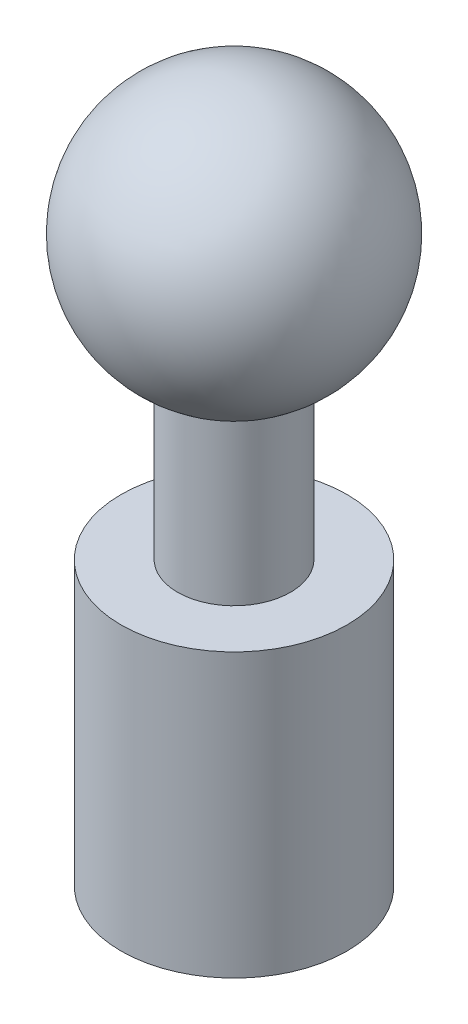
ISO-10303-21;
HEADER;
FILE_DESCRIPTION(('STEP AP214'),'2;1');
FILE_NAME('part.step','',(''),(''),'','','');
FILE_SCHEMA(('AUTOMOTIVE_DESIGN { 1 0 10303 214 1 1 1 1 }'));
ENDSEC;
DATA;
#1=APPLICATION_CONTEXT('core data for automotive mechanical design processes');
#2=APPLICATION_PROTOCOL_DEFINITION('international standard','automotive_design',2000,#1);
#3=PRODUCT_CONTEXT('',#1,'mechanical');
#4=PRODUCT('Part','Part','',(#3));
#5=PRODUCT_RELATED_PRODUCT_CATEGORY('part','',(#4));
#6=PRODUCT_DEFINITION_FORMATION('','',#4);
#7=PRODUCT_DEFINITION_CONTEXT('part definition',#1,'design');
#8=PRODUCT_DEFINITION('design','',#6,#7);
#9=PRODUCT_DEFINITION_SHAPE('','',#8);
#10=(LENGTH_UNIT() NAMED_UNIT(*) SI_UNIT(.MILLI.,.METRE.));
#11=(NAMED_UNIT(*) PLANE_ANGLE_UNIT() SI_UNIT($,.RADIAN.));
#12=(NAMED_UNIT(*) SI_UNIT($,.STERADIAN.) SOLID_ANGLE_UNIT());
#13=UNCERTAINTY_MEASURE_WITH_UNIT(LENGTH_MEASURE(1.E-05),#10,'distance_accuracy_value','');
#14=(GEOMETRIC_REPRESENTATION_CONTEXT(3) GLOBAL_UNCERTAINTY_ASSIGNED_CONTEXT((#13)) GLOBAL_UNIT_ASSIGNED_CONTEXT((#10,
#11,#12)) REPRESENTATION_CONTEXT('',''));
#15=CARTESIAN_POINT('',(0.,0.,0.));
#16=DIRECTION('',(0.,0.,1.));
#17=DIRECTION('',(1.,0.,0.));
#18=AXIS2_PLACEMENT_3D('',#15,#16,#17);
#19=CARTESIAN_POINT('',(0.,3.5,0.));
#20=DIRECTION('',(0.,-1.,0.));
#21=DIRECTION('',(0.,0.,-1.));
#22=AXIS2_PLACEMENT_3D('',#19,#20,#21);
#23=PLANE('',#22);
#24=CARTESIAN_POINT('',(0.,3.5,0.));
#25=DIRECTION('',(0.,-1.,0.));
#26=DIRECTION('',(0.,0.,-1.));
#27=AXIS2_PLACEMENT_3D('',#24,#25,#26);
#28=CIRCLE('',#27,1.13);
#29=CARTESIAN_POINT('',(-0.745574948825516,3.49999999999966,0.849127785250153));
#30=VERTEX_POINT('',#29);
#31=CARTESIAN_POINT('',(-1.12645521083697,3.49972671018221,0.0838187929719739));
#32=VERTEX_POINT('',#31);
#33=EDGE_CURVE('E105',#30,#32,#28,.T.);
#34=ORIENTED_EDGE('',*,*,#33,.T.);
#35=CARTESIAN_POINT('',(-1.12593141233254,3.5,0.0838061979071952));
#36=CARTESIAN_POINT('',(-1.12483021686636,3.5,0.0686119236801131));
#37=CARTESIAN_POINT('',(-1.1234719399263,3.5,0.0534336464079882));
#38=CARTESIAN_POINT('',(-1.12017700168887,3.5,0.0231370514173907));
#39=CARTESIAN_POINT('',(-1.11824021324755,3.5,0.00801874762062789));
#40=CARTESIAN_POINT('',(-1.11372387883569,3.5,-0.0221270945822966));
#41=CARTESIAN_POINT('',(-1.11114416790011,3.5,-0.0371546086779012));
#42=CARTESIAN_POINT('',(-1.10530919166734,3.5,-0.0670754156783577));
#43=CARTESIAN_POINT('',(-1.10205397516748,3.5,-0.0819687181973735));
#44=CARTESIAN_POINT('',(-1.09129615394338,3.5,-0.126404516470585));
#45=CARTESIAN_POINT('',(-1.08279966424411,3.5,-0.155714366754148));
#46=CARTESIAN_POINT('',(-1.06322234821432,3.5,-0.213438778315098));
#47=CARTESIAN_POINT('',(-1.05214188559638,3.5,-0.241853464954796));
#48=CARTESIAN_POINT('',(-1.01566699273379,3.5,-0.324215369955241));
#49=CARTESIAN_POINT('',(-0.98670657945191,3.5,-0.376638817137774));
#50=CARTESIAN_POINT('',(-0.920070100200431,3.5,-0.475497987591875));
#51=CARTESIAN_POINT('',(-0.88240221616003,3.5,-0.521939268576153));
#52=CARTESIAN_POINT('',(-0.801303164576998,3.5,-0.605568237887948));
#53=CARTESIAN_POINT('',(-0.758204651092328,3.5,-0.643076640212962));
#54=CARTESIAN_POINT('',(-0.689308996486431,3.5,-0.693484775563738));
#55=CARTESIAN_POINT('',(-0.665609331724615,3.5,-0.709324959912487));
#56=CARTESIAN_POINT('',(-0.616941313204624,3.5,-0.738959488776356));
#57=CARTESIAN_POINT('',(-0.591972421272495,3.5,-0.752752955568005));
#58=CARTESIAN_POINT('',(-0.540907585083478,3.5,-0.778196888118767));
#59=CARTESIAN_POINT('',(-0.5148096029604,3.5,-0.789843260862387));
#60=CARTESIAN_POINT('',(-0.47501774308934,3.5,-0.805652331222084));
#61=CARTESIAN_POINT('',(-0.461650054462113,3.5,-0.81064413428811));
#62=CARTESIAN_POINT('',(-0.434676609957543,3.5,-0.819937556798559));
#63=CARTESIAN_POINT('',(-0.421070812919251,3.5,-0.824239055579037));
#64=CARTESIAN_POINT('',(-0.352691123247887,3.5,-0.843946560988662));
#65=CARTESIAN_POINT('',(-0.296286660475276,3.5,-0.854162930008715));
#66=CARTESIAN_POINT('',(-0.189523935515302,3.5,-0.862359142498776));
#67=CARTESIAN_POINT('',(-0.139254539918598,3.5,-0.861663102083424));
#68=CARTESIAN_POINT('',(-0.0396677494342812,3.5,-0.851199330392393));
#69=CARTESIAN_POINT('',(0.00965044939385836,3.5,-0.841439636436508));
#70=CARTESIAN_POINT('',(0.0893661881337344,3.5,-0.817952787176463));
#71=CARTESIAN_POINT('',(0.120513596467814,3.5,-0.806689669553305));
#72=CARTESIAN_POINT('',(0.181147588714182,3.5,-0.780539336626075));
#73=CARTESIAN_POINT('',(0.210638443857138,3.5,-0.765662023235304));
#74=CARTESIAN_POINT('',(0.239139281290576,3.5,-0.749048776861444));
#75=B_SPLINE_CURVE_WITH_KNOTS('',3,(#35,#36,#37,#38,#39,#40,#41,#42,#43,#44,#45,#46,#47,#48,#49,
#50,#51,#52,#53,#54,#55,#56,#57,#58,#59,#60,#61,#62,#63,#64,#65,#66,#67,#68,#69,#70,#71,#72,#73,
#74),.UNSPECIFIED.,.F.,.F.,(4,2,2,2,2,2,2,2,2,2,2,2,2,2,2,2,2,2,2,4),(0.,0.0457040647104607,
0.0914181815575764,0.137144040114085,0.182866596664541,0.274277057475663,0.365674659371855,
0.544332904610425,0.722823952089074,0.893340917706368,0.978774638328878,1.06424489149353,
1.14987642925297,1.19266878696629,1.23546861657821,1.4060531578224,1.55611787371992,
1.7060496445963,1.80519032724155,1.9040623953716),.UNSPECIFIED.);
#76=CARTESIAN_POINT('',(0.239139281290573,3.5,-0.749048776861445));
#77=VERTEX_POINT('',#76);
#78=EDGE_CURVE('E12',#32,#77,#75,.T.);
#79=ORIENTED_EDGE('',*,*,#78,.T.);
#80=CARTESIAN_POINT('',(0.239139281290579,3.5,-0.749048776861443));
#81=CARTESIAN_POINT('',(0.281291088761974,3.5,-0.735630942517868));
#82=CARTESIAN_POINT('',(0.322274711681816,3.5,-0.718590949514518));
#83=CARTESIAN_POINT('',(0.400786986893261,3.5,-0.677914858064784));
#84=CARTESIAN_POINT('',(0.438318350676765,3.5,-0.654283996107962));
#85=CARTESIAN_POINT('',(0.50889465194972,3.5,-0.601038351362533));
#86=CARTESIAN_POINT('',(0.541937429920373,3.5,-0.571420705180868));
#87=CARTESIAN_POINT('',(0.602577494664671,3.5,-0.507065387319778));
#88=CARTESIAN_POINT('',(0.630175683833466,3.5,-0.472328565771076));
#89=CARTESIAN_POINT('',(0.67915095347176,3.5,-0.398711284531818));
#90=CARTESIAN_POINT('',(0.700527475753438,3.5,-0.359830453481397));
#91=CARTESIAN_POINT('',(0.736449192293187,3.5,-0.279031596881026));
#92=CARTESIAN_POINT('',(0.750994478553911,3.5,-0.237113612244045));
#93=CARTESIAN_POINT('',(0.772844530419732,3.5,-0.151423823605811));
#94=CARTESIAN_POINT('',(0.780147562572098,3.5,-0.107651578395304));
#95=CARTESIAN_POINT('',(0.787295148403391,3.5,-0.019509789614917));
#96=CARTESIAN_POINT('',(0.787143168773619,3.5,0.0248594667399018));
#97=CARTESIAN_POINT('',(0.780531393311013,3.5,0.100071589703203));
#98=CARTESIAN_POINT('',(0.775922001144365,3.5,0.131089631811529));
#99=CARTESIAN_POINT('',(0.763055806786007,3.5,0.192320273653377));
#100=CARTESIAN_POINT('',(0.754803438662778,3.5,0.222533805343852));
#101=CARTESIAN_POINT('',(0.74476724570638,3.49999999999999,0.252157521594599));
#102=B_SPLINE_CURVE_WITH_KNOTS('',3,(#80,#81,#82,#83,#84,#85,#86,#87,#88,#89,#90,#91,#92,#93,
#94,#95,#96,#97,#98,#99,#100,#101),.UNSPECIFIED.,.F.,.F.,(4,2,2,2,2,2,2,2,2,2,4),(0.,
0.132531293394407,0.264957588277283,0.39744737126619,0.529915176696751,0.662394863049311,
0.794872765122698,0.927382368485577,1.05983035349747,1.15369540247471,1.24744651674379),.UNSPECIFIED.);
#103=CARTESIAN_POINT('',(0.744767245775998,3.50000000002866,0.252157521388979));
#104=VERTEX_POINT('',#103);
#105=EDGE_CURVE('E52',#77,#104,#102,.T.);
#106=ORIENTED_EDGE('',*,*,#105,.T.);
#107=CARTESIAN_POINT('',(0.744767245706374,3.5,0.252157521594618));
#108=CARTESIAN_POINT('',(0.740978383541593,3.50000000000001,0.289420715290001));
#109=CARTESIAN_POINT('',(0.734551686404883,3.5,0.326391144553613));
#110=CARTESIAN_POINT('',(0.716611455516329,3.5,0.39912761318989));
#111=CARTESIAN_POINT('',(0.705091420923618,3.49999999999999,0.434892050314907));
#112=CARTESIAN_POINT('',(0.674307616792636,3.50000000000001,0.511618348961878));
#113=CARTESIAN_POINT('',(0.653941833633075,3.50000000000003,0.552146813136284));
#114=CARTESIAN_POINT('',(0.618597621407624,3.49999999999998,0.609918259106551));
#115=CARTESIAN_POINT('',(0.606015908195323,3.49999999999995,0.62867307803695));
#116=CARTESIAN_POINT('',(0.579339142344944,3.50000000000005,0.665075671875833));
#117=CARTESIAN_POINT('',(0.565244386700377,3.50000000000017,0.682723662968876));
#118=CARTESIAN_POINT('',(0.535527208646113,3.50000000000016,0.716920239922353));
#119=CARTESIAN_POINT('',(0.519893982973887,3.50000000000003,0.733459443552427));
#120=CARTESIAN_POINT('',(0.495463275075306,3.49999999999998,0.75725633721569));
#121=CARTESIAN_POINT('',(0.487154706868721,3.5,0.765021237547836));
#122=CARTESIAN_POINT('',(0.470212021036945,3.5,0.780187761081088));
#123=CARTESIAN_POINT('',(0.461577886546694,3.5,0.787589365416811));
#124=CARTESIAN_POINT('',(0.43527031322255,3.5,0.809343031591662));
#125=CARTESIAN_POINT('',(0.417208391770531,3.5,0.823228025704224));
#126=CARTESIAN_POINT('',(0.380181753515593,3.5,0.849734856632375));
#127=CARTESIAN_POINT('',(0.361216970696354,3.5,0.86235660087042));
#128=CARTESIAN_POINT('',(0.320352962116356,3.5,0.887559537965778));
#129=CARTESIAN_POINT('',(0.298358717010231,3.5,0.899987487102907));
#130=CARTESIAN_POINT('',(0.253492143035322,3.5,0.923123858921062));
#131=CARTESIAN_POINT('',(0.230619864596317,3.5,0.93383238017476));
#132=CARTESIAN_POINT('',(0.160893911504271,3.5,0.963270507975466));
#133=CARTESIAN_POINT('',(0.112884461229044,3.5,0.979341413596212));
#134=CARTESIAN_POINT('',(0.0100032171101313,3.5,1.00522398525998));
#135=CARTESIAN_POINT('',(-0.0450695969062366,3.5,1.01423180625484));
#136=CARTESIAN_POINT('',(-0.155971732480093,3.5,1.02289574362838));
#137=CARTESIAN_POINT('',(-0.211801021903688,3.50000000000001,1.02255225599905));
#138=CARTESIAN_POINT('',(-0.29493691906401,3.50000000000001,1.01507271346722));
#139=CARTESIAN_POINT('',(-0.322598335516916,3.5,1.01140549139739));
#140=CARTESIAN_POINT('',(-0.377520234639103,3.5,1.00177003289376));
#141=CARTESIAN_POINT('',(-0.404780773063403,3.5,0.995802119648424));
#142=CARTESIAN_POINT('',(-0.458722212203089,3.5,0.981615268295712));
#143=CARTESIAN_POINT('',(-0.485402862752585,3.5,0.973395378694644));
#144=CARTESIAN_POINT('',(-0.537972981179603,3.5,0.954745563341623));
#145=CARTESIAN_POINT('',(-0.563862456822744,3.49999999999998,0.944315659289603));
#146=CARTESIAN_POINT('',(-0.616436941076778,3.50000000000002,0.920973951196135));
#147=CARTESIAN_POINT('',(-0.643070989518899,3.50000000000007,0.907947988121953));
#148=CARTESIAN_POINT('',(-0.695194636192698,3.49999999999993,0.879973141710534));
#149=CARTESIAN_POINT('',(-0.720687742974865,3.49999999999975,0.865030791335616));
#150=CARTESIAN_POINT('',(-0.745574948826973,3.49999999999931,0.849127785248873));
#151=B_SPLINE_CURVE_WITH_KNOTS('',3,(#107,#108,#109,#110,#111,#112,#113,#114,#115,#116,#117,
#118,#119,#120,#121,#122,#123,#124,#125,#126,#127,#128,#129,#130,#131,#132,#133,#134,#135,#136,
#137,#138,#139,#140,#141,#142,#143,#144,#145,#146,#147,#148,#149,#150),.UNSPECIFIED.,.F.,.F.,(4,
2,2,2,2,2,2,2,2,2,2,2,2,2,2,2,2,2,2,2,2,4),(0.,0.112229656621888,0.224602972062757,
0.359963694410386,0.427653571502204,0.495330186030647,0.563521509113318,0.597628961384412,
0.631738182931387,0.700025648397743,0.768318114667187,0.844026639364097,0.919730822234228,
1.07097651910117,1.23762073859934,1.40425790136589,1.48788761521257,1.57150558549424,
1.65515894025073,1.73881147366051,1.82767684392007,1.91624694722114),.UNSPECIFIED.);
#152=EDGE_CURVE('E158',#104,#30,#151,.T.);
#153=ORIENTED_EDGE('',*,*,#152,.T.);
#154=EDGE_LOOP('',(#34,#79,#106,#153));
#155=FACE_BOUND('',#154,.T.);
#156=ADVANCED_FACE('F41',(#155),#23,.T.);
#157=CARTESIAN_POINT('',(0.,5.,0.));
#158=DIRECTION('',(0.,-1.,0.));
#159=DIRECTION('',(0.,0.,-1.));
#160=AXIS2_PLACEMENT_3D('',#157,#158,#159);
#161=CYLINDRICAL_SURFACE('',#160,2.);
#162=CARTESIAN_POINT('',(0.,5.,0.));
#163=DIRECTION('',(0.,1.,0.));
#164=DIRECTION('',(0.,0.,1.));
#165=AXIS2_PLACEMENT_3D('',#162,#163,#164);
#166=CIRCLE('',#165,2.);
#167=CARTESIAN_POINT('',(0.,5.,2.));
#168=VERTEX_POINT('',#167);
#169=EDGE_CURVE('E244',#168,#168,#166,.T.);
#170=ORIENTED_EDGE('',*,*,#169,.F.);
#171=EDGE_LOOP('',(#170));
#172=FACE_BOUND('',#171,.T.);
#173=CARTESIAN_POINT('',(0.,0.,0.));
#174=DIRECTION('',(0.,1.,0.));
#175=DIRECTION('',(0.,0.,1.));
#176=AXIS2_PLACEMENT_3D('',#173,#174,#175);
#177=CIRCLE('',#176,2.);
#178=CARTESIAN_POINT('',(0.,0.,2.));
#179=VERTEX_POINT('',#178);
#180=EDGE_CURVE('E162',#179,#179,#177,.T.);
#181=ORIENTED_EDGE('',*,*,#180,.T.);
#182=EDGE_LOOP('',(#181));
#183=FACE_BOUND('',#182,.T.);
#184=ADVANCED_FACE('F43',(#172,#183),#161,.T.);
#185=CARTESIAN_POINT('',(0.,5.,0.));
#186=DIRECTION('',(0.,1.,0.));
#187=DIRECTION('',(0.,0.,1.));
#188=AXIS2_PLACEMENT_3D('',#185,#186,#187);
#189=PLANE('',#188);
#190=CARTESIAN_POINT('',(0.,5.,0.));
#191=DIRECTION('',(0.,1.,0.));
#192=DIRECTION('',(0.,0.,1.));
#193=AXIS2_PLACEMENT_3D('',#190,#191,#192);
#194=CIRCLE('',#193,1.);
#195=CARTESIAN_POINT('',(0.,5.,1.));
#196=VERTEX_POINT('',#195);
#197=EDGE_CURVE('E169',#196,#196,#194,.T.);
#198=ORIENTED_EDGE('',*,*,#197,.F.);
#199=EDGE_LOOP('',(#198));
#200=FACE_BOUND('',#199,.T.);
#201=ORIENTED_EDGE('',*,*,#169,.T.);
#202=EDGE_LOOP('',(#201));
#203=FACE_BOUND('',#202,.T.);
#204=ADVANCED_FACE('F156',(#200,#203),#189,.T.);
#205=CARTESIAN_POINT('',(0.,0.,0.));
#206=DIRECTION('',(0.,1.,0.));
#207=DIRECTION('',(0.,0.,1.));
#208=AXIS2_PLACEMENT_3D('',#205,#206,#207);
#209=PLANE('',#208);
#210=CARTESIAN_POINT('',(0.,0.,0.));
#211=DIRECTION('',(0.,-1.,0.));
#212=DIRECTION('',(0.,0.,-1.));
#213=AXIS2_PLACEMENT_3D('',#210,#211,#212);
#214=CIRCLE('',#213,1.13);
#215=CARTESIAN_POINT('',(1.13,0.,0.));
#216=VERTEX_POINT('',#215);
#217=EDGE_CURVE('E108',#216,#216,#214,.T.);
#218=ORIENTED_EDGE('',*,*,#217,.F.);
#219=EDGE_LOOP('',(#218));
#220=FACE_BOUND('',#219,.T.);
#221=ORIENTED_EDGE('',*,*,#180,.F.);
#222=EDGE_LOOP('',(#221));
#223=FACE_BOUND('',#222,.T.);
#224=ADVANCED_FACE('F250',(#220,#223),#209,.F.);
#225=CARTESIAN_POINT('',(0.,8.,0.));
#226=DIRECTION('',(0.,-1.,0.));
#227=DIRECTION('',(0.,0.,-1.));
#228=AXIS2_PLACEMENT_3D('',#225,#226,#227);
#229=CYLINDRICAL_SURFACE('',#228,1.);
#230=CARTESIAN_POINT('',(0.,7.87209070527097,0.));
#231=DIRECTION('',(0.,1.,0.));
#232=DIRECTION('',(0.,0.,1.));
#233=AXIS2_PLACEMENT_3D('',#230,#231,#232);
#234=CIRCLE('',#233,1.);
#235=CARTESIAN_POINT('',(0.,7.87209070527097,1.));
#236=VERTEX_POINT('',#235);
#237=EDGE_CURVE('E159',#236,#236,#234,.F.);
#238=ORIENTED_EDGE('',*,*,#237,.T.);
#239=EDGE_LOOP('',(#238));
#240=FACE_BOUND('',#239,.T.);
#241=ORIENTED_EDGE('',*,*,#197,.T.);
#242=EDGE_LOOP('',(#241));
#243=FACE_BOUND('',#242,.T.);
#244=ADVANCED_FACE('F252',(#240,#243),#229,.T.);
#245=CARTESIAN_POINT('',(0.,9.99870773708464,0.));
#246=DIRECTION('',(0.,-1.,0.));
#247=DIRECTION('',(0.,0.,1.));
#248=AXIS2_PLACEMENT_3D('',#245,#246,#247);
#249=SPHERICAL_SURFACE('',#248,2.35);
#250=ORIENTED_EDGE('',*,*,#237,.F.);
#251=EDGE_LOOP('',(#250));
#252=FACE_BOUND('',#251,.T.);
#253=ADVANCED_FACE('F150',(#252),#249,.T.);
#254=CARTESIAN_POINT('',(0.,3.5,0.));
#255=DIRECTION('',(0.,-1.,0.));
#256=DIRECTION('',(0.,0.,-1.));
#257=AXIS2_PLACEMENT_3D('',#254,#255,#256);
#258=CYLINDRICAL_SURFACE('',#257,1.13);
#259=ORIENTED_EDGE('',*,*,#217,.T.);
#260=CARTESIAN_POINT('',(1.13,0.,0.));
#261=CARTESIAN_POINT('',(1.13,0.0529166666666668,-0.652405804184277));
#262=CARTESIAN_POINT('',(0.565,0.105833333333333,-0.978608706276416));
#263=CARTESIAN_POINT('',(0.,0.15875,-1.30481160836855));
#264=CARTESIAN_POINT('',(-0.565,0.211666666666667,-0.978608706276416));
#265=CARTESIAN_POINT('',(-1.13,0.264583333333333,-0.652405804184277));
#266=CARTESIAN_POINT('',(-1.13,0.3175,0.));
#267=CARTESIAN_POINT('',(-1.13,0.370416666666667,0.652405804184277));
#268=CARTESIAN_POINT('',(-0.565000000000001,0.423333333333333,0.978608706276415));
#269=CARTESIAN_POINT('',(0.,0.47625,1.30481160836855));
#270=CARTESIAN_POINT('',(0.564999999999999,0.529166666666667,0.978608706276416));
#271=CARTESIAN_POINT('',(1.13,0.582083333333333,0.652405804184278));
#272=CARTESIAN_POINT('',(1.13,0.635,0.));
#273=CARTESIAN_POINT('',(1.13,0.687916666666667,-0.652405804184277));
#274=CARTESIAN_POINT('',(0.565,0.740833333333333,-0.978608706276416));
#275=CARTESIAN_POINT('',(0.,0.79375,-1.30481160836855));
#276=CARTESIAN_POINT('',(-0.565,0.846666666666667,-0.978608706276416));
#277=CARTESIAN_POINT('',(-1.13,0.899583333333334,-0.652405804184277));
#278=CARTESIAN_POINT('',(-1.13,0.9525,0.));
#279=CARTESIAN_POINT('',(-1.13,1.00541666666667,0.652405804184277));
#280=CARTESIAN_POINT('',(-0.565000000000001,1.05833333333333,0.978608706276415));
#281=CARTESIAN_POINT('',(0.,1.11125,1.30481160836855));
#282=CARTESIAN_POINT('',(0.564999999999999,1.16416666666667,0.978608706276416));
#283=CARTESIAN_POINT('',(1.13,1.21708333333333,0.652405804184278));
#284=CARTESIAN_POINT('',(1.13,1.27,0.));
#285=CARTESIAN_POINT('',(1.13,1.32291666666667,-0.652405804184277));
#286=CARTESIAN_POINT('',(0.565,1.37583333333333,-0.978608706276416));
#287=CARTESIAN_POINT('',(0.,1.42875,-1.30481160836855));
#288=CARTESIAN_POINT('',(-0.565,1.48166666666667,-0.978608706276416));
#289=CARTESIAN_POINT('',(-1.13,1.53458333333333,-0.652405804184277));
#290=CARTESIAN_POINT('',(-1.13,1.5875,0.));
#291=CARTESIAN_POINT('',(-1.13,1.64041666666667,0.652405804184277));
#292=CARTESIAN_POINT('',(-0.565000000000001,1.69333333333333,0.978608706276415));
#293=CARTESIAN_POINT('',(0.,1.74625,1.30481160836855));
#294=CARTESIAN_POINT('',(0.564999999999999,1.79916666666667,0.978608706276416));
#295=CARTESIAN_POINT('',(1.13,1.85208333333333,0.652405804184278));
#296=CARTESIAN_POINT('',(1.13,1.905,0.));
#297=CARTESIAN_POINT('',(1.13,1.95791666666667,-0.652405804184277));
#298=CARTESIAN_POINT('',(0.565,2.01083333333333,-0.978608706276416));
#299=CARTESIAN_POINT('',(0.,2.06375,-1.30481160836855));
#300=CARTESIAN_POINT('',(-0.565,2.11666666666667,-0.978608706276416));
#301=CARTESIAN_POINT('',(-1.13,2.16958333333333,-0.652405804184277));
#302=CARTESIAN_POINT('',(-1.13,2.2225,0.));
#303=CARTESIAN_POINT('',(-1.13,2.27541666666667,0.652405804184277));
#304=CARTESIAN_POINT('',(-0.565000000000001,2.32833333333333,0.978608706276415));
#305=CARTESIAN_POINT('',(0.,2.38125,1.30481160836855));
#306=CARTESIAN_POINT('',(0.564999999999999,2.43416666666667,0.978608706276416));
#307=CARTESIAN_POINT('',(1.13,2.48708333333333,0.652405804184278));
#308=CARTESIAN_POINT('',(1.13,2.54,0.));
#309=CARTESIAN_POINT('',(1.13,2.59291666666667,-0.652405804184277));
#310=CARTESIAN_POINT('',(0.565,2.64583333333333,-0.978608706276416));
#311=CARTESIAN_POINT('',(0.,2.69875,-1.30481160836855));
#312=CARTESIAN_POINT('',(-0.565,2.75166666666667,-0.978608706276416));
#313=CARTESIAN_POINT('',(-1.13,2.80458333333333,-0.652405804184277));
#314=CARTESIAN_POINT('',(-1.13,2.8575,0.));
#315=CARTESIAN_POINT('',(-1.13,2.91041666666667,0.652405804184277));
#316=CARTESIAN_POINT('',(-0.565000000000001,2.96333333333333,0.978608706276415));
#317=CARTESIAN_POINT('',(0.,3.01625,1.30481160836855));
#318=CARTESIAN_POINT('',(0.564999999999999,3.06916666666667,0.978608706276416));
#319=CARTESIAN_POINT('',(1.13,3.12208333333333,0.652405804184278));
#320=CARTESIAN_POINT('',(1.13,3.175,0.));
#321=CARTESIAN_POINT('',(1.13,3.22791666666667,-0.652405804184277));
#322=CARTESIAN_POINT('',(0.565,3.28083333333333,-0.978608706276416));
#323=CARTESIAN_POINT('',(0.,3.33375,-1.30481160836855));
#324=CARTESIAN_POINT('',(-0.565,3.38666666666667,-0.978608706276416));
#325=CARTESIAN_POINT('',(-1.13,3.43958333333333,-0.652405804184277));
#326=CARTESIAN_POINT('',(-1.13,3.4925,0.));
#327=CARTESIAN_POINT('',(-1.13,3.4959063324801,0.0419964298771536));
#328=CARTESIAN_POINT('',(-1.12688271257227,3.49944924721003,0.0838770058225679));
#329=(BOUNDED_CURVE() B_SPLINE_CURVE(2,(#260,#261,#262,#263,#264,#265,#266,#267,#268,#269,#270,
#271,#272,#273,#274,#275,#276,#277,#278,#279,#280,#281,#282,#283,#284,#285,#286,#287,#288,#289,
#290,#291,#292,#293,#294,#295,#296,#297,#298,#299,#300,#301,#302,#303,#304,#305,#306,#307,#308,
#309,#310,#311,#312,#313,#314,#315,#316,#317,#318,#319,#320,#321,#322,#323,#324,#325,#326,#327,
#328),.UNSPECIFIED.,.F.,.F.) B_SPLINE_CURVE_WITH_KNOTS((3,2,2,2,2,2,2,2,2,2,2,2,2,2,2,2,2,2,2,2,
2,2,2,2,2,2,2,2,2,2,2,2,2,2,3),(0.,0.0277777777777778,0.0555555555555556,0.0833333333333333,
0.111111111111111,0.138888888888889,0.166666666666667,0.194444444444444,0.222222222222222,0.25,
0.277777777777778,0.305555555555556,0.333333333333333,0.361111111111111,0.388888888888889,
0.416666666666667,0.444444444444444,0.472222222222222,0.5,0.527777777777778,0.555555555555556,
0.583333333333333,0.611111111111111,0.638888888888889,0.666666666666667,0.694444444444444,
0.722222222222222,0.75,0.777777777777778,0.805555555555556,0.833333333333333,0.861111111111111,
0.888888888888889,0.916666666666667,0.91871102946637),
.UNSPECIFIED.) CURVE() GEOMETRIC_REPRESENTATION_ITEM() RATIONAL_B_SPLINE_CURVE((1.,
0.866025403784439,1.,0.866025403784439,1.,0.866025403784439,1.,0.866025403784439,1.,
0.866025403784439,1.,0.866025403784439,1.,0.866025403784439,1.,0.866025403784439,1.,
0.866025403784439,1.,0.866025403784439,1.,0.866025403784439,1.,0.866025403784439,1.,
0.866025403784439,1.,0.866025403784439,1.,0.866025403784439,1.,0.866025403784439,1.,
0.866025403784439,1.,0.866025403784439,1.,0.866025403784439,1.,0.866025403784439,1.,
0.866025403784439,1.,0.866025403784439,1.,0.866025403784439,1.,0.866025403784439,1.,
0.866025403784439,1.,0.866025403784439,1.,0.866025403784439,1.,0.866025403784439,1.,
0.866025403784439,1.,0.866025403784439,1.,0.866025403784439,1.,0.866025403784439,1.,
0.866025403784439,1.,0.990139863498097,0.981731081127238)) REPRESENTATION_ITEM(''));
#330=EDGE_CURVE('E99',#216,#32,#329,.T.);
#331=ORIENTED_EDGE('',*,*,#330,.T.);
#332=ORIENTED_EDGE('',*,*,#33,.F.);
#333=CARTESIAN_POINT('',(1.13,0.555624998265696,0.));
#334=CARTESIAN_POINT('',(1.13,0.608541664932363,-0.652405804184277));
#335=CARTESIAN_POINT('',(0.565,0.66145833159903,-0.978608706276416));
#336=CARTESIAN_POINT('',(0.,0.714374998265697,-1.30481160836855));
#337=CARTESIAN_POINT('',(-0.565,0.767291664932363,-0.978608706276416));
#338=CARTESIAN_POINT('',(-1.13,0.82020833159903,-0.652405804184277));
#339=CARTESIAN_POINT('',(-1.13,0.873124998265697,0.));
#340=CARTESIAN_POINT('',(-1.13,0.926041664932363,0.652405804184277));
#341=CARTESIAN_POINT('',(-0.565000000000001,0.97895833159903,0.978608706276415));
#342=CARTESIAN_POINT('',(0.,1.0318749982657,1.30481160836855));
#343=CARTESIAN_POINT('',(0.564999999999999,1.08479166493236,0.978608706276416));
#344=CARTESIAN_POINT('',(1.13,1.13770833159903,0.652405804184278));
#345=CARTESIAN_POINT('',(1.13,1.1906249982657,0.));
#346=CARTESIAN_POINT('',(1.13,1.24354166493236,-0.652405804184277));
#347=CARTESIAN_POINT('',(0.565,1.29645833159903,-0.978608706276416));
#348=CARTESIAN_POINT('',(0.,1.3493749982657,-1.30481160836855));
#349=CARTESIAN_POINT('',(-0.565,1.40229166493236,-0.978608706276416));
#350=CARTESIAN_POINT('',(-1.13,1.45520833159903,-0.652405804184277));
#351=CARTESIAN_POINT('',(-1.13,1.5081249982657,0.));
#352=CARTESIAN_POINT('',(-1.13,1.56104166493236,0.652405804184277));
#353=CARTESIAN_POINT('',(-0.565000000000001,1.61395833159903,0.978608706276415));
#354=CARTESIAN_POINT('',(0.,1.6668749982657,1.30481160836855));
#355=CARTESIAN_POINT('',(0.564999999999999,1.71979166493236,0.978608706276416));
#356=CARTESIAN_POINT('',(1.13,1.77270833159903,0.652405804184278));
#357=CARTESIAN_POINT('',(1.13,1.8256249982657,0.));
#358=CARTESIAN_POINT('',(1.13,1.87854166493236,-0.652405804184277));
#359=CARTESIAN_POINT('',(0.565,1.93145833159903,-0.978608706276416));
#360=CARTESIAN_POINT('',(0.,1.9843749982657,-1.30481160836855));
#361=CARTESIAN_POINT('',(-0.565,2.03729166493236,-0.978608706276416));
#362=CARTESIAN_POINT('',(-1.13,2.09020833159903,-0.652405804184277));
#363=CARTESIAN_POINT('',(-1.13,2.1431249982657,0.));
#364=CARTESIAN_POINT('',(-1.13,2.19604166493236,0.652405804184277));
#365=CARTESIAN_POINT('',(-0.565000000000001,2.24895833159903,0.978608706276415));
#366=CARTESIAN_POINT('',(0.,2.3018749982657,1.30481160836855));
#367=CARTESIAN_POINT('',(0.564999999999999,2.35479166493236,0.978608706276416));
#368=CARTESIAN_POINT('',(1.13,2.40770833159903,0.652405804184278));
#369=CARTESIAN_POINT('',(1.13,2.4606249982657,0.));
#370=CARTESIAN_POINT('',(1.13,2.51354166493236,-0.652405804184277));
#371=CARTESIAN_POINT('',(0.565,2.56645833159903,-0.978608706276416));
#372=CARTESIAN_POINT('',(0.,2.6193749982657,-1.30481160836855));
#373=CARTESIAN_POINT('',(-0.565,2.67229166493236,-0.978608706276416));
#374=CARTESIAN_POINT('',(-1.13,2.72520833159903,-0.652405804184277));
#375=CARTESIAN_POINT('',(-1.13,2.7781249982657,0.));
#376=CARTESIAN_POINT('',(-1.13,2.83104166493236,0.652405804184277));
#377=CARTESIAN_POINT('',(-0.565000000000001,2.88395833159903,0.978608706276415));
#378=CARTESIAN_POINT('',(0.,2.9368749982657,1.30481160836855));
#379=CARTESIAN_POINT('',(0.564999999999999,2.98979166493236,0.978608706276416));
#380=CARTESIAN_POINT('',(1.13,3.04270833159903,0.652405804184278));
#381=CARTESIAN_POINT('',(1.13,3.0956249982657,0.));
#382=CARTESIAN_POINT('',(1.13,3.14854166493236,-0.652405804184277));
#383=CARTESIAN_POINT('',(0.565,3.20145833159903,-0.978608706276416));
#384=CARTESIAN_POINT('',(0.,3.2543749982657,-1.30481160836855));
#385=CARTESIAN_POINT('',(-0.565,3.30729166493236,-0.978608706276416));
#386=CARTESIAN_POINT('',(-1.13,3.36020833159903,-0.652405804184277));
#387=CARTESIAN_POINT('',(-1.13,3.4131249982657,0.));
#388=CARTESIAN_POINT('',(-1.13,3.46604166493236,0.652405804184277));
#389=CARTESIAN_POINT('',(-0.565000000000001,3.51895833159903,0.978608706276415));
#390=CARTESIAN_POINT('',(0.,3.5718749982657,1.30481160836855));
#391=CARTESIAN_POINT('',(0.564999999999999,3.62479166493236,0.978608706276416));
#392=CARTESIAN_POINT('',(1.13,3.67770833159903,0.652405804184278));
#393=CARTESIAN_POINT('',(1.13,3.7306249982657,0.));
#394=CARTESIAN_POINT('',(1.13,3.78354166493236,-0.652405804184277));
#395=CARTESIAN_POINT('',(0.565,3.83645833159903,-0.978608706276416));
#396=CARTESIAN_POINT('',(0.,3.8893749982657,-1.30481160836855));
#397=CARTESIAN_POINT('',(-0.565,3.94229166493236,-0.978608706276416));
#398=CARTESIAN_POINT('',(-1.13,3.99520833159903,-0.652405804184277));
#399=CARTESIAN_POINT('',(-1.13,4.0481249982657,0.));
#400=CARTESIAN_POINT('',(-1.13,4.05152933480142,0.0419718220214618));
#401=CARTESIAN_POINT('',(-1.12688635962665,4.05507009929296,0.0838279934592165));
#402=(BOUNDED_CURVE() B_SPLINE_CURVE(2,(#333,#334,#335,#336,#337,#338,#339,#340,#341,#342,#343,
#344,#345,#346,#347,#348,#349,#350,#351,#352,#353,#354,#355,#356,#357,#358,#359,#360,#361,#362,
#363,#364,#365,#366,#367,#368,#369,#370,#371,#372,#373,#374,#375,#376,#377,#378,#379,#380,#381,
#382,#383,#384,#385,#386,#387,#388,#389,#390,#391,#392,#393,#394,#395,#396,#397,#398,#399,#400,
#401),.UNSPECIFIED.,.F.,.F.) B_SPLINE_CURVE_WITH_KNOTS((3,2,2,2,2,2,2,2,2,2,2,2,2,2,2,2,2,2,2,2,
2,2,2,2,2,2,2,2,2,2,2,2,2,2,3),(0.,0.0277777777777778,0.0555555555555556,0.0833333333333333,
0.111111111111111,0.138888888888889,0.166666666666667,0.194444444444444,0.222222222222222,0.25,
0.277777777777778,0.305555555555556,0.333333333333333,0.361111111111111,0.388888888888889,
0.416666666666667,0.444444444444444,0.472222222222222,0.5,0.527777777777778,0.555555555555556,
0.583333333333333,0.611111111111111,0.638888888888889,0.666666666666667,0.694444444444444,
0.722222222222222,0.75,0.777777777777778,0.805555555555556,0.833333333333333,0.861111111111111,
0.888888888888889,0.916666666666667,0.918709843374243),
.UNSPECIFIED.) CURVE() GEOMETRIC_REPRESENTATION_ITEM() RATIONAL_B_SPLINE_CURVE((1.,
0.866025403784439,1.,0.866025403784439,1.,0.866025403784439,1.,0.866025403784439,1.,
0.866025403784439,1.,0.866025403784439,1.,0.866025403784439,1.,0.866025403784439,1.,
0.866025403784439,1.,0.866025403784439,1.,0.866025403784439,1.,0.866025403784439,1.,
0.866025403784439,1.,0.866025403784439,1.,0.866025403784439,1.,0.866025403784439,1.,
0.866025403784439,1.,0.866025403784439,1.,0.866025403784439,1.,0.866025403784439,1.,
0.866025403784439,1.,0.866025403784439,1.,0.866025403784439,1.,0.866025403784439,1.,
0.866025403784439,1.,0.866025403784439,1.,0.866025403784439,1.,0.866025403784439,1.,
0.866025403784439,1.,0.866025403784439,1.,0.866025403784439,1.,0.866025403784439,1.,
0.866025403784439,1.,0.990145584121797,0.981740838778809)) REPRESENTATION_ITEM(''));
#403=CARTESIAN_POINT('',(1.13,0.555624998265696,0.));
#404=VERTEX_POINT('',#403);
#405=EDGE_CURVE('E45',#404,#30,#402,.T.);
#406=ORIENTED_EDGE('',*,*,#405,.F.);
#407=CARTESIAN_POINT('',(1.13,0.,0.));
#408=CARTESIAN_POINT('',(1.13,0.555624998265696,0.));
#409=(BOUNDED_CURVE() B_SPLINE_CURVE(1,(#407,#408),.UNSPECIFIED.,.F.,
.F.) B_SPLINE_CURVE_WITH_KNOTS((2,2),(0.,1.),
.UNSPECIFIED.) CURVE() GEOMETRIC_REPRESENTATION_ITEM() RATIONAL_B_SPLINE_CURVE((1.,1.)) REPRESENTATION_ITEM(''));
#410=EDGE_CURVE('E85',#216,#404,#409,.T.);
#411=ORIENTED_EDGE('',*,*,#410,.F.);
#412=EDGE_LOOP('',(#259,#331,#332,#406,#411));
#413=FACE_BOUND('',#412,.T.);
#414=ADVANCED_FACE('F102',(#413),#258,.F.);
#415=CARTESIAN_POINT('',(0.9581480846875,0.0992187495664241,0.));
#416=DIRECTION('',(0.,0.,1.));
#417=DIRECTION('',(1.,0.,0.));
#418=AXIS2_PLACEMENT_3D('',#415,#416,#417);
#419=PLANE('',#418);
#420=CARTESIAN_POINT('',(0.786296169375,0.198437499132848,0.));
#421=CARTESIAN_POINT('',(1.13,0.,0.));
#422=(BOUNDED_CURVE() B_SPLINE_CURVE(1,(#420,#421),.UNSPECIFIED.,.F.,
.F.) B_SPLINE_CURVE_WITH_KNOTS((2,2),(0.,1.),
.UNSPECIFIED.) CURVE() GEOMETRIC_REPRESENTATION_ITEM() RATIONAL_B_SPLINE_CURVE((1.,1.)) REPRESENTATION_ITEM(''));
#423=CARTESIAN_POINT('',(0.786296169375,0.198437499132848,0.));
#424=VERTEX_POINT('',#423);
#425=EDGE_CURVE('E91',#424,#216,#422,.T.);
#426=ORIENTED_EDGE('',*,*,#425,.T.);
#427=ORIENTED_EDGE('',*,*,#410,.T.);
#428=CARTESIAN_POINT('',(1.13,0.555624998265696,0.));
#429=CARTESIAN_POINT('',(0.786296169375,0.357187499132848,0.));
#430=(BOUNDED_CURVE() B_SPLINE_CURVE(1,(#428,#429),.UNSPECIFIED.,.F.,
.F.) B_SPLINE_CURVE_WITH_KNOTS((2,2),(0.,1.),
.UNSPECIFIED.) CURVE() GEOMETRIC_REPRESENTATION_ITEM() RATIONAL_B_SPLINE_CURVE((1.,1.)) REPRESENTATION_ITEM(''));
#431=CARTESIAN_POINT('',(0.786296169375,0.357187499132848,0.));
#432=VERTEX_POINT('',#431);
#433=EDGE_CURVE('E88',#404,#432,#430,.T.);
#434=ORIENTED_EDGE('',*,*,#433,.T.);
#435=CARTESIAN_POINT('',(0.786296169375,0.357187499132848,0.));
#436=CARTESIAN_POINT('',(0.786296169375,0.198437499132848,0.));
#437=(BOUNDED_CURVE() B_SPLINE_CURVE(1,(#435,#436),.UNSPECIFIED.,.F.,
.F.) B_SPLINE_CURVE_WITH_KNOTS((2,2),(0.,1.),
.UNSPECIFIED.) CURVE() GEOMETRIC_REPRESENTATION_ITEM() RATIONAL_B_SPLINE_CURVE((1.,1.)) REPRESENTATION_ITEM(''));
#438=EDGE_CURVE('E214',#432,#424,#437,.T.);
#439=ORIENTED_EDGE('',*,*,#438,.T.);
#440=EDGE_LOOP('',(#426,#427,#434,#439));
#441=FACE_BOUND('',#440,.T.);
#442=ADVANCED_FACE('F86',(#441),#419,.T.);
#443=CARTESIAN_POINT('',(0.786296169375,0.198437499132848,0.));
#444=CARTESIAN_POINT('',(0.786296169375,0.251354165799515,-0.453968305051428));
#445=CARTESIAN_POINT('',(0.3931480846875,0.304270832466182,-0.680952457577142));
#446=CARTESIAN_POINT('',(0.,0.357187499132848,-0.907936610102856));
#447=CARTESIAN_POINT('',(-0.3931480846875,0.410104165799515,-0.680952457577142));
#448=CARTESIAN_POINT('',(-0.786296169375,0.463020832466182,-0.453968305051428));
#449=CARTESIAN_POINT('',(-0.786296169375,0.515937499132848,0.));
#450=CARTESIAN_POINT('',(-0.786296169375,0.568854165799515,0.453968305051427));
#451=CARTESIAN_POINT('',(-0.3931480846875,0.621770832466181,0.680952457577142));
#452=CARTESIAN_POINT('',(0.,0.674687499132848,0.907936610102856));
#453=CARTESIAN_POINT('',(0.393148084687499,0.727604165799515,0.680952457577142));
#454=CARTESIAN_POINT('',(0.786296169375,0.780520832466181,0.453968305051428));
#455=CARTESIAN_POINT('',(0.786296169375,0.833437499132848,0.));
#456=CARTESIAN_POINT('',(0.786296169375,0.886354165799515,-0.453968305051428));
#457=CARTESIAN_POINT('',(0.3931480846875,0.939270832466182,-0.680952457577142));
#458=CARTESIAN_POINT('',(0.,0.992187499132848,-0.907936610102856));
#459=CARTESIAN_POINT('',(-0.3931480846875,1.04510416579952,-0.680952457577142));
#460=CARTESIAN_POINT('',(-0.786296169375,1.09802083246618,-0.453968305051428));
#461=CARTESIAN_POINT('',(-0.786296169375,1.15093749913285,0.));
#462=CARTESIAN_POINT('',(-0.786296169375,1.20385416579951,0.453968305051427));
#463=CARTESIAN_POINT('',(-0.3931480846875,1.25677083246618,0.680952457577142));
#464=CARTESIAN_POINT('',(0.,1.30968749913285,0.907936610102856));
#465=CARTESIAN_POINT('',(0.393148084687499,1.36260416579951,0.680952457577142));
#466=CARTESIAN_POINT('',(0.786296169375,1.41552083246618,0.453968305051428));
#467=CARTESIAN_POINT('',(0.786296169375,1.46843749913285,0.));
#468=CARTESIAN_POINT('',(0.786296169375,1.52135416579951,-0.453968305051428));
#469=CARTESIAN_POINT('',(0.3931480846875,1.57427083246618,-0.680952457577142));
#470=CARTESIAN_POINT('',(0.,1.62718749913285,-0.907936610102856));
#471=CARTESIAN_POINT('',(-0.3931480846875,1.68010416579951,-0.680952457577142));
#472=CARTESIAN_POINT('',(-0.786296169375,1.73302083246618,-0.453968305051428));
#473=CARTESIAN_POINT('',(-0.786296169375,1.78593749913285,0.));
#474=CARTESIAN_POINT('',(-0.786296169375,1.83885416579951,0.453968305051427));
#475=CARTESIAN_POINT('',(-0.3931480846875,1.89177083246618,0.680952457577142));
#476=CARTESIAN_POINT('',(0.,1.94468749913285,0.907936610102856));
#477=CARTESIAN_POINT('',(0.393148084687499,1.99760416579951,0.680952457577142));
#478=CARTESIAN_POINT('',(0.786296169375,2.05052083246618,0.453968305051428));
#479=CARTESIAN_POINT('',(0.786296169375,2.10343749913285,0.));
#480=CARTESIAN_POINT('',(0.786296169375,2.15635416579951,-0.453968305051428));
#481=CARTESIAN_POINT('',(0.3931480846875,2.20927083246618,-0.680952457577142));
#482=CARTESIAN_POINT('',(0.,2.26218749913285,-0.907936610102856));
#483=CARTESIAN_POINT('',(-0.3931480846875,2.31510416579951,-0.680952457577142));
#484=CARTESIAN_POINT('',(-0.786296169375,2.36802083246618,-0.453968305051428));
#485=CARTESIAN_POINT('',(-0.786296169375,2.42093749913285,0.));
#486=CARTESIAN_POINT('',(-0.786296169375,2.47385416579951,0.453968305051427));
#487=CARTESIAN_POINT('',(-0.3931480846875,2.52677083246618,0.680952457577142));
#488=CARTESIAN_POINT('',(0.,2.57968749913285,0.907936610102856));
#489=CARTESIAN_POINT('',(0.393148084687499,2.63260416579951,0.680952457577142));
#490=CARTESIAN_POINT('',(0.786296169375,2.68552083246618,0.453968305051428));
#491=CARTESIAN_POINT('',(0.786296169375,2.73843749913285,0.));
#492=CARTESIAN_POINT('',(0.786296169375,2.79135416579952,-0.453968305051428));
#493=CARTESIAN_POINT('',(0.3931480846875,2.84427083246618,-0.680952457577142));
#494=CARTESIAN_POINT('',(0.,2.89718749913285,-0.907936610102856));
#495=CARTESIAN_POINT('',(-0.3931480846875,2.95010416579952,-0.680952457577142));
#496=CARTESIAN_POINT('',(-0.786296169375,3.00302083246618,-0.453968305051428));
#497=CARTESIAN_POINT('',(-0.786296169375,3.05593749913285,0.));
#498=CARTESIAN_POINT('',(-0.786296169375,3.10885416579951,0.453968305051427));
#499=CARTESIAN_POINT('',(-0.3931480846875,3.16177083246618,0.680952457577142));
#500=CARTESIAN_POINT('',(0.,3.21468749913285,0.907936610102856));
#501=CARTESIAN_POINT('',(0.393148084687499,3.26760416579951,0.680952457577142));
#502=CARTESIAN_POINT('',(0.786296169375,3.32052083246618,0.453968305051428));
#503=CARTESIAN_POINT('',(0.786296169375,3.37343749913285,0.));
#504=CARTESIAN_POINT('',(0.786296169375,3.42635416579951,-0.453968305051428));
#505=CARTESIAN_POINT('',(0.3931480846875,3.47927083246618,-0.680952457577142));
#506=CARTESIAN_POINT('',(0.,3.53218749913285,-0.907936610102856));
#507=CARTESIAN_POINT('',(-0.3931480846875,3.58510416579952,-0.680952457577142));
#508=CARTESIAN_POINT('',(-0.786296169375,3.63802083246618,-0.453968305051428));
#509=CARTESIAN_POINT('',(-0.786296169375,3.69093749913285,0.));
#510=CARTESIAN_POINT('',(-0.786296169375,3.69434383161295,0.0292226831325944));
#511=CARTESIAN_POINT('',(-0.784127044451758,3.69788674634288,0.058364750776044));
#512=CARTESIAN_POINT('',(1.13,0.,0.));
#513=CARTESIAN_POINT('',(1.13,0.0529166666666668,-0.652405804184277));
#514=CARTESIAN_POINT('',(0.565,0.105833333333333,-0.978608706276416));
#515=CARTESIAN_POINT('',(0.,0.15875,-1.30481160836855));
#516=CARTESIAN_POINT('',(-0.565,0.211666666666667,-0.978608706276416));
#517=CARTESIAN_POINT('',(-1.13,0.264583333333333,-0.652405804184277));
#518=CARTESIAN_POINT('',(-1.13,0.3175,0.));
#519=CARTESIAN_POINT('',(-1.13,0.370416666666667,0.652405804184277));
#520=CARTESIAN_POINT('',(-0.565000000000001,0.423333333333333,0.978608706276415));
#521=CARTESIAN_POINT('',(0.,0.47625,1.30481160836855));
#522=CARTESIAN_POINT('',(0.564999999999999,0.529166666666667,0.978608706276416));
#523=CARTESIAN_POINT('',(1.13,0.582083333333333,0.652405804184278));
#524=CARTESIAN_POINT('',(1.13,0.635,0.));
#525=CARTESIAN_POINT('',(1.13,0.687916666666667,-0.652405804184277));
#526=CARTESIAN_POINT('',(0.565,0.740833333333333,-0.978608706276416));
#527=CARTESIAN_POINT('',(0.,0.79375,-1.30481160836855));
#528=CARTESIAN_POINT('',(-0.565,0.846666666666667,-0.978608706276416));
#529=CARTESIAN_POINT('',(-1.13,0.899583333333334,-0.652405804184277));
#530=CARTESIAN_POINT('',(-1.13,0.9525,0.));
#531=CARTESIAN_POINT('',(-1.13,1.00541666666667,0.652405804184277));
#532=CARTESIAN_POINT('',(-0.565000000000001,1.05833333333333,0.978608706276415));
#533=CARTESIAN_POINT('',(0.,1.11125,1.30481160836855));
#534=CARTESIAN_POINT('',(0.564999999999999,1.16416666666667,0.978608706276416));
#535=CARTESIAN_POINT('',(1.13,1.21708333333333,0.652405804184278));
#536=CARTESIAN_POINT('',(1.13,1.27,0.));
#537=CARTESIAN_POINT('',(1.13,1.32291666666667,-0.652405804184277));
#538=CARTESIAN_POINT('',(0.565,1.37583333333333,-0.978608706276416));
#539=CARTESIAN_POINT('',(0.,1.42875,-1.30481160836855));
#540=CARTESIAN_POINT('',(-0.565,1.48166666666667,-0.978608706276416));
#541=CARTESIAN_POINT('',(-1.13,1.53458333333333,-0.652405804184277));
#542=CARTESIAN_POINT('',(-1.13,1.5875,0.));
#543=CARTESIAN_POINT('',(-1.13,1.64041666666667,0.652405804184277));
#544=CARTESIAN_POINT('',(-0.565000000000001,1.69333333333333,0.978608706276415));
#545=CARTESIAN_POINT('',(0.,1.74625,1.30481160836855));
#546=CARTESIAN_POINT('',(0.564999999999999,1.79916666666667,0.978608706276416));
#547=CARTESIAN_POINT('',(1.13,1.85208333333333,0.652405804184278));
#548=CARTESIAN_POINT('',(1.13,1.905,0.));
#549=CARTESIAN_POINT('',(1.13,1.95791666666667,-0.652405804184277));
#550=CARTESIAN_POINT('',(0.565,2.01083333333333,-0.978608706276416));
#551=CARTESIAN_POINT('',(0.,2.06375,-1.30481160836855));
#552=CARTESIAN_POINT('',(-0.565,2.11666666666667,-0.978608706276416));
#553=CARTESIAN_POINT('',(-1.13,2.16958333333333,-0.652405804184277));
#554=CARTESIAN_POINT('',(-1.13,2.2225,0.));
#555=CARTESIAN_POINT('',(-1.13,2.27541666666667,0.652405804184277));
#556=CARTESIAN_POINT('',(-0.565000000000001,2.32833333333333,0.978608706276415));
#557=CARTESIAN_POINT('',(0.,2.38125,1.30481160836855));
#558=CARTESIAN_POINT('',(0.564999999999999,2.43416666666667,0.978608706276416));
#559=CARTESIAN_POINT('',(1.13,2.48708333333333,0.652405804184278));
#560=CARTESIAN_POINT('',(1.13,2.54,0.));
#561=CARTESIAN_POINT('',(1.13,2.59291666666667,-0.652405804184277));
#562=CARTESIAN_POINT('',(0.565,2.64583333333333,-0.978608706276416));
#563=CARTESIAN_POINT('',(0.,2.69875,-1.30481160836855));
#564=CARTESIAN_POINT('',(-0.565,2.75166666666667,-0.978608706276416));
#565=CARTESIAN_POINT('',(-1.13,2.80458333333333,-0.652405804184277));
#566=CARTESIAN_POINT('',(-1.13,2.8575,0.));
#567=CARTESIAN_POINT('',(-1.13,2.91041666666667,0.652405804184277));
#568=CARTESIAN_POINT('',(-0.565000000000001,2.96333333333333,0.978608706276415));
#569=CARTESIAN_POINT('',(0.,3.01625,1.30481160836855));
#570=CARTESIAN_POINT('',(0.564999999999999,3.06916666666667,0.978608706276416));
#571=CARTESIAN_POINT('',(1.13,3.12208333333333,0.652405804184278));
#572=CARTESIAN_POINT('',(1.13,3.175,0.));
#573=CARTESIAN_POINT('',(1.13,3.22791666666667,-0.652405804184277));
#574=CARTESIAN_POINT('',(0.565,3.28083333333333,-0.978608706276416));
#575=CARTESIAN_POINT('',(0.,3.33375,-1.30481160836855));
#576=CARTESIAN_POINT('',(-0.565,3.38666666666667,-0.978608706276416));
#577=CARTESIAN_POINT('',(-1.13,3.43958333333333,-0.652405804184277));
#578=CARTESIAN_POINT('',(-1.13,3.4925,0.));
#579=CARTESIAN_POINT('',(-1.13,3.4959063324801,0.0419964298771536));
#580=CARTESIAN_POINT('',(-1.12688271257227,3.49944924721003,0.0838770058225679));
#581=(BOUNDED_SURFACE() B_SPLINE_SURFACE(1,2,((#443,#444,#445,#446,#447,#448,#449,#450,#451,
#452,#453,#454,#455,#456,#457,#458,#459,#460,#461,#462,#463,#464,#465,#466,#467,#468,#469,#470,
#471,#472,#473,#474,#475,#476,#477,#478,#479,#480,#481,#482,#483,#484,#485,#486,#487,#488,#489,
#490,#491,#492,#493,#494,#495,#496,#497,#498,#499,#500,#501,#502,#503,#504,#505,#506,#507,#508,
#509,#510,#511),(#512,#513,#514,#515,#516,#517,#518,#519,#520,#521,#522,#523,#524,#525,#526,
#527,#528,#529,#530,#531,#532,#533,#534,#535,#536,#537,#538,#539,#540,#541,#542,#543,#544,#545,
#546,#547,#548,#549,#550,#551,#552,#553,#554,#555,#556,#557,#558,#559,#560,#561,#562,#563,#564,
#565,#566,#567,#568,#569,#570,#571,#572,#573,#574,#575,#576,#577,#578,#579,#580)),.UNSPECIFIED.,
.F.,.F.,.F.) B_SPLINE_SURFACE_WITH_KNOTS((2,2),(3,2,2,2,2,2,2,2,2,2,2,2,2,2,2,2,2,2,2,2,2,2,2,2,
2,2,2,2,2,2,2,2,2,2,3),(0.,1.),(0.,0.0277777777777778,0.0555555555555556,0.0833333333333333,
0.111111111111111,0.138888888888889,0.166666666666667,0.194444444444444,0.222222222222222,0.25,
0.277777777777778,0.305555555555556,0.333333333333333,0.361111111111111,0.388888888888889,
0.416666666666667,0.444444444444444,0.472222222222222,0.5,0.527777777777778,0.555555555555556,
0.583333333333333,0.611111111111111,0.638888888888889,0.666666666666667,0.694444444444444,
0.722222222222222,0.75,0.777777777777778,0.805555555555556,0.833333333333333,0.861111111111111,
0.888888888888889,0.916666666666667,0.91871102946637),
.UNSPECIFIED.) GEOMETRIC_REPRESENTATION_ITEM() RATIONAL_B_SPLINE_SURFACE(((1.,0.866025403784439,
1.,0.866025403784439,1.,0.866025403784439,1.,0.866025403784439,1.,0.866025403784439,1.,
0.866025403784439,1.,0.866025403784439,1.,0.866025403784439,1.,0.866025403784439,1.,
0.866025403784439,1.,0.866025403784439,1.,0.866025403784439,1.,0.866025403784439,1.,
0.866025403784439,1.,0.866025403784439,1.,0.866025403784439,1.,0.866025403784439,1.,
0.866025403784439,1.,0.866025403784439,1.,0.866025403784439,1.,0.866025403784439,1.,
0.866025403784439,1.,0.866025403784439,1.,0.866025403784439,1.,0.866025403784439,1.,
0.866025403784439,1.,0.866025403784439,1.,0.866025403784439,1.,0.866025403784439,1.,
0.866025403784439,1.,0.866025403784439,1.,0.866025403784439,1.,0.866025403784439,1.,
0.990139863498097,0.981731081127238),(1.,0.866025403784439,1.,0.866025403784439,1.,
0.866025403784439,1.,0.866025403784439,1.,0.866025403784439,1.,0.866025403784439,1.,
0.866025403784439,1.,0.866025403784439,1.,0.866025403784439,1.,0.866025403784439,1.,
0.866025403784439,1.,0.866025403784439,1.,0.866025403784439,1.,0.866025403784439,1.,
0.866025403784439,1.,0.866025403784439,1.,0.866025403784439,1.,0.866025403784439,1.,
0.866025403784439,1.,0.866025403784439,1.,0.866025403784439,1.,0.866025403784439,1.,
0.866025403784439,1.,0.866025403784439,1.,0.866025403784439,1.,0.866025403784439,1.,
0.866025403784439,1.,0.866025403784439,1.,0.866025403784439,1.,0.866025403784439,1.,
0.866025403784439,1.,0.866025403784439,1.,0.866025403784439,1.,0.990139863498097,0.981731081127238))) REPRESENTATION_ITEM('') SURFACE());
#582=CARTESIAN_POINT('',(0.786296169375,0.198437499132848,0.));
#583=CARTESIAN_POINT('',(0.786296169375,0.251354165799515,-0.453968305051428));
#584=CARTESIAN_POINT('',(0.3931480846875,0.304270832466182,-0.680952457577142));
#585=CARTESIAN_POINT('',(0.,0.357187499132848,-0.907936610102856));
#586=CARTESIAN_POINT('',(-0.3931480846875,0.410104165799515,-0.680952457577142));
#587=CARTESIAN_POINT('',(-0.786296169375,0.463020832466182,-0.453968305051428));
#588=CARTESIAN_POINT('',(-0.786296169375,0.515937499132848,0.));
#589=CARTESIAN_POINT('',(-0.786296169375,0.568854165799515,0.453968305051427));
#590=CARTESIAN_POINT('',(-0.3931480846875,0.621770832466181,0.680952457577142));
#591=CARTESIAN_POINT('',(0.,0.674687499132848,0.907936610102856));
#592=CARTESIAN_POINT('',(0.393148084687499,0.727604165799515,0.680952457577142));
#593=CARTESIAN_POINT('',(0.786296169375,0.780520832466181,0.453968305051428));
#594=CARTESIAN_POINT('',(0.786296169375,0.833437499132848,0.));
#595=CARTESIAN_POINT('',(0.786296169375,0.886354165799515,-0.453968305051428));
#596=CARTESIAN_POINT('',(0.3931480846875,0.939270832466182,-0.680952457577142));
#597=CARTESIAN_POINT('',(0.,0.992187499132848,-0.907936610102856));
#598=CARTESIAN_POINT('',(-0.3931480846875,1.04510416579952,-0.680952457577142));
#599=CARTESIAN_POINT('',(-0.786296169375,1.09802083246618,-0.453968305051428));
#600=CARTESIAN_POINT('',(-0.786296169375,1.15093749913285,0.));
#601=CARTESIAN_POINT('',(-0.786296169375,1.20385416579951,0.453968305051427));
#602=CARTESIAN_POINT('',(-0.3931480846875,1.25677083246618,0.680952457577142));
#603=CARTESIAN_POINT('',(0.,1.30968749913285,0.907936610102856));
#604=CARTESIAN_POINT('',(0.393148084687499,1.36260416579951,0.680952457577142));
#605=CARTESIAN_POINT('',(0.786296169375,1.41552083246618,0.453968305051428));
#606=CARTESIAN_POINT('',(0.786296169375,1.46843749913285,0.));
#607=CARTESIAN_POINT('',(0.786296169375,1.52135416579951,-0.453968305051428));
#608=CARTESIAN_POINT('',(0.3931480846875,1.57427083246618,-0.680952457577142));
#609=CARTESIAN_POINT('',(0.,1.62718749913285,-0.907936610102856));
#610=CARTESIAN_POINT('',(-0.3931480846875,1.68010416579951,-0.680952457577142));
#611=CARTESIAN_POINT('',(-0.786296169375,1.73302083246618,-0.453968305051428));
#612=CARTESIAN_POINT('',(-0.786296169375,1.78593749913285,0.));
#613=CARTESIAN_POINT('',(-0.786296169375,1.83885416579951,0.453968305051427));
#614=CARTESIAN_POINT('',(-0.3931480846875,1.89177083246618,0.680952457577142));
#615=CARTESIAN_POINT('',(0.,1.94468749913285,0.907936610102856));
#616=CARTESIAN_POINT('',(0.393148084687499,1.99760416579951,0.680952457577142));
#617=CARTESIAN_POINT('',(0.786296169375,2.05052083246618,0.453968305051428));
#618=CARTESIAN_POINT('',(0.786296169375,2.10343749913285,0.));
#619=CARTESIAN_POINT('',(0.786296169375,2.15635416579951,-0.453968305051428));
#620=CARTESIAN_POINT('',(0.3931480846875,2.20927083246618,-0.680952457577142));
#621=CARTESIAN_POINT('',(0.,2.26218749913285,-0.907936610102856));
#622=CARTESIAN_POINT('',(-0.3931480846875,2.31510416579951,-0.680952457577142));
#623=CARTESIAN_POINT('',(-0.786296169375,2.36802083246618,-0.453968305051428));
#624=CARTESIAN_POINT('',(-0.786296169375,2.42093749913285,0.));
#625=CARTESIAN_POINT('',(-0.786296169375,2.47385416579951,0.453968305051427));
#626=CARTESIAN_POINT('',(-0.3931480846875,2.52677083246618,0.680952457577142));
#627=CARTESIAN_POINT('',(0.,2.57968749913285,0.907936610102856));
#628=CARTESIAN_POINT('',(0.393148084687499,2.63260416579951,0.680952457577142));
#629=CARTESIAN_POINT('',(0.786296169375,2.68552083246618,0.453968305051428));
#630=CARTESIAN_POINT('',(0.786296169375,2.73843749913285,0.));
#631=CARTESIAN_POINT('',(0.786296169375,2.79135416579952,-0.453968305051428));
#632=CARTESIAN_POINT('',(0.3931480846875,2.84427083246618,-0.680952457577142));
#633=CARTESIAN_POINT('',(0.,2.89718749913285,-0.907936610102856));
#634=CARTESIAN_POINT('',(-0.3931480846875,2.95010416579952,-0.680952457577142));
#635=CARTESIAN_POINT('',(-0.786296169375,3.00302083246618,-0.453968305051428));
#636=CARTESIAN_POINT('',(-0.786296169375,3.05593749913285,0.));
#637=CARTESIAN_POINT('',(-0.786296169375,3.10885416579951,0.453968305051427));
#638=CARTESIAN_POINT('',(-0.3931480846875,3.16177083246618,0.680952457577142));
#639=CARTESIAN_POINT('',(0.,3.21468749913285,0.907936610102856));
#640=CARTESIAN_POINT('',(0.393148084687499,3.26760416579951,0.680952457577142));
#641=CARTESIAN_POINT('',(0.786296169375,3.32052083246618,0.453968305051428));
#642=CARTESIAN_POINT('',(0.786296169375,3.37343749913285,0.));
#643=CARTESIAN_POINT('',(0.786296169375,3.42635416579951,-0.453968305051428));
#644=CARTESIAN_POINT('',(0.3931480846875,3.47927083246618,-0.680952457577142));
#645=CARTESIAN_POINT('',(0.,3.53218749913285,-0.907936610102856));
#646=CARTESIAN_POINT('',(-0.3931480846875,3.58510416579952,-0.680952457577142));
#647=CARTESIAN_POINT('',(-0.786296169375,3.63802083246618,-0.453968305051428));
#648=CARTESIAN_POINT('',(-0.786296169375,3.69093749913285,0.));
#649=CARTESIAN_POINT('',(-0.786296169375,3.69434383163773,0.0292226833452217));
#650=CARTESIAN_POINT('',(-0.784127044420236,3.69788674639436,0.0583647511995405));
#651=(BOUNDED_CURVE() B_SPLINE_CURVE(2,(#582,#583,#584,#585,#586,#587,#588,#589,#590,#591,#592,
#593,#594,#595,#596,#597,#598,#599,#600,#601,#602,#603,#604,#605,#606,#607,#608,#609,#610,#611,
#612,#613,#614,#615,#616,#617,#618,#619,#620,#621,#622,#623,#624,#625,#626,#627,#628,#629,#630,
#631,#632,#633,#634,#635,#636,#637,#638,#639,#640,#641,#642,#643,#644,#645,#646,#647,#648,#649,
#650),.UNSPECIFIED.,.F.,.F.) B_SPLINE_CURVE_WITH_KNOTS((3,2,2,2,2,2,2,2,2,2,2,2,2,2,2,2,2,2,2,2,
2,2,2,2,2,2,2,2,2,2,2,2,2,2,3),(0.,0.0277777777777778,0.0555555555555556,0.0833333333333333,
0.111111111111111,0.138888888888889,0.166666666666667,0.194444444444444,0.222222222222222,0.25,
0.277777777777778,0.305555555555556,0.333333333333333,0.361111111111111,0.388888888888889,
0.416666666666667,0.444444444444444,0.472222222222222,0.5,0.527777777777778,0.555555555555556,
0.583333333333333,0.611111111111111,0.638888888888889,0.666666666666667,0.694444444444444,
0.722222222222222,0.75,0.777777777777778,0.805555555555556,0.833333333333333,0.861111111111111,
0.888888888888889,0.916666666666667,0.918711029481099),
.UNSPECIFIED.) CURVE() GEOMETRIC_REPRESENTATION_ITEM() RATIONAL_B_SPLINE_CURVE((1.,
0.866025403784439,1.,0.866025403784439,1.,0.866025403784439,1.,0.866025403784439,1.,
0.866025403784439,1.,0.866025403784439,1.,0.866025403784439,1.,0.866025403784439,1.,
0.866025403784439,1.,0.866025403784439,1.,0.866025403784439,1.,0.866025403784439,1.,
0.866025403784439,1.,0.866025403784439,1.,0.866025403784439,1.,0.866025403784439,1.,
0.866025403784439,1.,0.866025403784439,1.,0.866025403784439,1.,0.866025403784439,1.,
0.866025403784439,1.,0.866025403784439,1.,0.866025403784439,1.,0.866025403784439,1.,
0.866025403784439,1.,0.866025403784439,1.,0.866025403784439,1.,0.866025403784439,1.,
0.866025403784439,1.,0.866025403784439,1.,0.866025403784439,1.,0.866025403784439,1.,
0.866025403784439,1.,0.990139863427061,0.981731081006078)) REPRESENTATION_ITEM(''));
#652=EDGE_CURVE('E219',#424,#77,#651,.T.);
#653=ORIENTED_EDGE('',*,*,#78,.F.);
#654=ORIENTED_EDGE('',*,*,#330,.F.);
#655=ORIENTED_EDGE('',*,*,#425,.F.);
#656=ORIENTED_EDGE('',*,*,#652,.T.);
#657=EDGE_LOOP('',(#653,#654,#655,#656));
#658=FACE_BOUND('',#657,.T.);
#659=ADVANCED_FACE('F128',(#658),#581,.F.);
#660=CARTESIAN_POINT('',(0.786296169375,0.357187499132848,0.));
#661=CARTESIAN_POINT('',(0.786296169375,0.410104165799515,-0.453968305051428));
#662=CARTESIAN_POINT('',(0.3931480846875,0.463020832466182,-0.680952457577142));
#663=CARTESIAN_POINT('',(0.,0.515937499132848,-0.907936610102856));
#664=CARTESIAN_POINT('',(-0.3931480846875,0.568854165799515,-0.680952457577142));
#665=CARTESIAN_POINT('',(-0.786296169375,0.621770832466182,-0.453968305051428));
#666=CARTESIAN_POINT('',(-0.786296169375,0.674687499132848,0.));
#667=CARTESIAN_POINT('',(-0.786296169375,0.727604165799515,0.453968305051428));
#668=CARTESIAN_POINT('',(-0.3931480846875,0.780520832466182,0.680952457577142));
#669=CARTESIAN_POINT('',(0.,0.833437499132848,0.907936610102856));
#670=CARTESIAN_POINT('',(0.3931480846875,0.886354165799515,0.680952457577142));
#671=CARTESIAN_POINT('',(0.786296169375,0.939270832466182,0.453968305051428));
#672=CARTESIAN_POINT('',(0.786296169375,0.992187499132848,0.));
#673=CARTESIAN_POINT('',(0.786296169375,1.04510416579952,-0.453968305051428));
#674=CARTESIAN_POINT('',(0.3931480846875,1.09802083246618,-0.680952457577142));
#675=CARTESIAN_POINT('',(0.,1.15093749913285,-0.907936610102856));
#676=CARTESIAN_POINT('',(-0.3931480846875,1.20385416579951,-0.680952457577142));
#677=CARTESIAN_POINT('',(-0.786296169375,1.25677083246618,-0.453968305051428));
#678=CARTESIAN_POINT('',(-0.786296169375,1.30968749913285,0.));
#679=CARTESIAN_POINT('',(-0.786296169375,1.36260416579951,0.453968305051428));
#680=CARTESIAN_POINT('',(-0.3931480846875,1.41552083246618,0.680952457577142));
#681=CARTESIAN_POINT('',(0.,1.46843749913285,0.907936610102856));
#682=CARTESIAN_POINT('',(0.3931480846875,1.52135416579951,0.680952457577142));
#683=CARTESIAN_POINT('',(0.786296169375,1.57427083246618,0.453968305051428));
#684=CARTESIAN_POINT('',(0.786296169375,1.62718749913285,0.));
#685=CARTESIAN_POINT('',(0.786296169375,1.68010416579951,-0.453968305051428));
#686=CARTESIAN_POINT('',(0.3931480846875,1.73302083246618,-0.680952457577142));
#687=CARTESIAN_POINT('',(0.,1.78593749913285,-0.907936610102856));
#688=CARTESIAN_POINT('',(-0.3931480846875,1.83885416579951,-0.680952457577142));
#689=CARTESIAN_POINT('',(-0.786296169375,1.89177083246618,-0.453968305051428));
#690=CARTESIAN_POINT('',(-0.786296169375,1.94468749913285,0.));
#691=CARTESIAN_POINT('',(-0.786296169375,1.99760416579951,0.453968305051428));
#692=CARTESIAN_POINT('',(-0.3931480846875,2.05052083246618,0.680952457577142));
#693=CARTESIAN_POINT('',(0.,2.10343749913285,0.907936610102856));
#694=CARTESIAN_POINT('',(0.3931480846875,2.15635416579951,0.680952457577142));
#695=CARTESIAN_POINT('',(0.786296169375,2.20927083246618,0.453968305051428));
#696=CARTESIAN_POINT('',(0.786296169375,2.26218749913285,0.));
#697=CARTESIAN_POINT('',(0.786296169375,2.31510416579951,-0.453968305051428));
#698=CARTESIAN_POINT('',(0.3931480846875,2.36802083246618,-0.680952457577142));
#699=CARTESIAN_POINT('',(0.,2.42093749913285,-0.907936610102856));
#700=CARTESIAN_POINT('',(-0.3931480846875,2.47385416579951,-0.680952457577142));
#701=CARTESIAN_POINT('',(-0.786296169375,2.52677083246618,-0.453968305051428));
#702=CARTESIAN_POINT('',(-0.786296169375,2.57968749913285,0.));
#703=CARTESIAN_POINT('',(-0.786296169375,2.63260416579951,0.453968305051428));
#704=CARTESIAN_POINT('',(-0.3931480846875,2.68552083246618,0.680952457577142));
#705=CARTESIAN_POINT('',(0.,2.73843749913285,0.907936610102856));
#706=CARTESIAN_POINT('',(0.3931480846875,2.79135416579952,0.680952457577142));
#707=CARTESIAN_POINT('',(0.786296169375,2.84427083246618,0.453968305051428));
#708=CARTESIAN_POINT('',(0.786296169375,2.89718749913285,0.));
#709=CARTESIAN_POINT('',(0.786296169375,2.95010416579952,-0.453968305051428));
#710=CARTESIAN_POINT('',(0.3931480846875,3.00302083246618,-0.680952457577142));
#711=CARTESIAN_POINT('',(0.,3.05593749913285,-0.907936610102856));
#712=CARTESIAN_POINT('',(-0.3931480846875,3.10885416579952,-0.680952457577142));
#713=CARTESIAN_POINT('',(-0.786296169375,3.16177083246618,-0.453968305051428));
#714=CARTESIAN_POINT('',(-0.786296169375,3.21468749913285,0.));
#715=CARTESIAN_POINT('',(-0.786296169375,3.26760416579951,0.453968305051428));
#716=CARTESIAN_POINT('',(-0.3931480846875,3.32052083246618,0.680952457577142));
#717=CARTESIAN_POINT('',(0.,3.37343749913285,0.907936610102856));
#718=CARTESIAN_POINT('',(0.3931480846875,3.42635416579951,0.680952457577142));
#719=CARTESIAN_POINT('',(0.786296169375,3.47927083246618,0.453968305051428));
#720=CARTESIAN_POINT('',(0.786296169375,3.53218749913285,0.));
#721=CARTESIAN_POINT('',(0.786296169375,3.58510416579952,-0.453968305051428));
#722=CARTESIAN_POINT('',(0.3931480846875,3.63802083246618,-0.680952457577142));
#723=CARTESIAN_POINT('',(0.,3.69093749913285,-0.907936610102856));
#724=CARTESIAN_POINT('',(-0.3931480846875,3.74385416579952,-0.680952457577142));
#725=CARTESIAN_POINT('',(-0.786296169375,3.79677083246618,-0.453968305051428));
#726=CARTESIAN_POINT('',(-0.786296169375,3.84968749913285,0.));
#727=CARTESIAN_POINT('',(-0.786296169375,3.85309383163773,0.0292226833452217));
#728=CARTESIAN_POINT('',(-0.784127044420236,3.85663674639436,0.0583647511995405));
#729=CARTESIAN_POINT('',(0.786296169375,0.198437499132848,0.));
#730=CARTESIAN_POINT('',(0.786296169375,0.251354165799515,-0.453968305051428));
#731=CARTESIAN_POINT('',(0.3931480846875,0.304270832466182,-0.680952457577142));
#732=CARTESIAN_POINT('',(0.,0.357187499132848,-0.907936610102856));
#733=CARTESIAN_POINT('',(-0.3931480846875,0.410104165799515,-0.680952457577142));
#734=CARTESIAN_POINT('',(-0.786296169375,0.463020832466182,-0.453968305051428));
#735=CARTESIAN_POINT('',(-0.786296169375,0.515937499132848,0.));
#736=CARTESIAN_POINT('',(-0.786296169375,0.568854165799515,0.453968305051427));
#737=CARTESIAN_POINT('',(-0.3931480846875,0.621770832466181,0.680952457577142));
#738=CARTESIAN_POINT('',(0.,0.674687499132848,0.907936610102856));
#739=CARTESIAN_POINT('',(0.393148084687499,0.727604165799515,0.680952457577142));
#740=CARTESIAN_POINT('',(0.786296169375,0.780520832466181,0.453968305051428));
#741=CARTESIAN_POINT('',(0.786296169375,0.833437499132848,0.));
#742=CARTESIAN_POINT('',(0.786296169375,0.886354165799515,-0.453968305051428));
#743=CARTESIAN_POINT('',(0.3931480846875,0.939270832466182,-0.680952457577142));
#744=CARTESIAN_POINT('',(0.,0.992187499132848,-0.907936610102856));
#745=CARTESIAN_POINT('',(-0.3931480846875,1.04510416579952,-0.680952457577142));
#746=CARTESIAN_POINT('',(-0.786296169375,1.09802083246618,-0.453968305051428));
#747=CARTESIAN_POINT('',(-0.786296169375,1.15093749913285,0.));
#748=CARTESIAN_POINT('',(-0.786296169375,1.20385416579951,0.453968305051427));
#749=CARTESIAN_POINT('',(-0.3931480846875,1.25677083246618,0.680952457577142));
#750=CARTESIAN_POINT('',(0.,1.30968749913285,0.907936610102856));
#751=CARTESIAN_POINT('',(0.393148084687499,1.36260416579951,0.680952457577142));
#752=CARTESIAN_POINT('',(0.786296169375,1.41552083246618,0.453968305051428));
#753=CARTESIAN_POINT('',(0.786296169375,1.46843749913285,0.));
#754=CARTESIAN_POINT('',(0.786296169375,1.52135416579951,-0.453968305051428));
#755=CARTESIAN_POINT('',(0.3931480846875,1.57427083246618,-0.680952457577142));
#756=CARTESIAN_POINT('',(0.,1.62718749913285,-0.907936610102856));
#757=CARTESIAN_POINT('',(-0.3931480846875,1.68010416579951,-0.680952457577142));
#758=CARTESIAN_POINT('',(-0.786296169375,1.73302083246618,-0.453968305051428));
#759=CARTESIAN_POINT('',(-0.786296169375,1.78593749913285,0.));
#760=CARTESIAN_POINT('',(-0.786296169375,1.83885416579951,0.453968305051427));
#761=CARTESIAN_POINT('',(-0.3931480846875,1.89177083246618,0.680952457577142));
#762=CARTESIAN_POINT('',(0.,1.94468749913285,0.907936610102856));
#763=CARTESIAN_POINT('',(0.393148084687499,1.99760416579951,0.680952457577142));
#764=CARTESIAN_POINT('',(0.786296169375,2.05052083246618,0.453968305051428));
#765=CARTESIAN_POINT('',(0.786296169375,2.10343749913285,0.));
#766=CARTESIAN_POINT('',(0.786296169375,2.15635416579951,-0.453968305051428));
#767=CARTESIAN_POINT('',(0.3931480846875,2.20927083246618,-0.680952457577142));
#768=CARTESIAN_POINT('',(0.,2.26218749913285,-0.907936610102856));
#769=CARTESIAN_POINT('',(-0.3931480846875,2.31510416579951,-0.680952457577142));
#770=CARTESIAN_POINT('',(-0.786296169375,2.36802083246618,-0.453968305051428));
#771=CARTESIAN_POINT('',(-0.786296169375,2.42093749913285,0.));
#772=CARTESIAN_POINT('',(-0.786296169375,2.47385416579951,0.453968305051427));
#773=CARTESIAN_POINT('',(-0.3931480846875,2.52677083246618,0.680952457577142));
#774=CARTESIAN_POINT('',(0.,2.57968749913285,0.907936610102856));
#775=CARTESIAN_POINT('',(0.393148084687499,2.63260416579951,0.680952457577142));
#776=CARTESIAN_POINT('',(0.786296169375,2.68552083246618,0.453968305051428));
#777=CARTESIAN_POINT('',(0.786296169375,2.73843749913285,0.));
#778=CARTESIAN_POINT('',(0.786296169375,2.79135416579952,-0.453968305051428));
#779=CARTESIAN_POINT('',(0.3931480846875,2.84427083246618,-0.680952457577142));
#780=CARTESIAN_POINT('',(0.,2.89718749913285,-0.907936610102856));
#781=CARTESIAN_POINT('',(-0.3931480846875,2.95010416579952,-0.680952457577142));
#782=CARTESIAN_POINT('',(-0.786296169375,3.00302083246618,-0.453968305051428));
#783=CARTESIAN_POINT('',(-0.786296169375,3.05593749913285,0.));
#784=CARTESIAN_POINT('',(-0.786296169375,3.10885416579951,0.453968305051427));
#785=CARTESIAN_POINT('',(-0.3931480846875,3.16177083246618,0.680952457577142));
#786=CARTESIAN_POINT('',(0.,3.21468749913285,0.907936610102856));
#787=CARTESIAN_POINT('',(0.393148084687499,3.26760416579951,0.680952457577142));
#788=CARTESIAN_POINT('',(0.786296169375,3.32052083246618,0.453968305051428));
#789=CARTESIAN_POINT('',(0.786296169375,3.37343749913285,0.));
#790=CARTESIAN_POINT('',(0.786296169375,3.42635416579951,-0.453968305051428));
#791=CARTESIAN_POINT('',(0.3931480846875,3.47927083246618,-0.680952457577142));
#792=CARTESIAN_POINT('',(0.,3.53218749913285,-0.907936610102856));
#793=CARTESIAN_POINT('',(-0.3931480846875,3.58510416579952,-0.680952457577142));
#794=CARTESIAN_POINT('',(-0.786296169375,3.63802083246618,-0.453968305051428));
#795=CARTESIAN_POINT('',(-0.786296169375,3.69093749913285,0.));
#796=CARTESIAN_POINT('',(-0.786296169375,3.69434383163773,0.0292226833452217));
#797=CARTESIAN_POINT('',(-0.784127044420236,3.69788674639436,0.0583647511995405));
#798=(BOUNDED_SURFACE() B_SPLINE_SURFACE(1,2,((#660,#661,#662,#663,#664,#665,#666,#667,#668,
#669,#670,#671,#672,#673,#674,#675,#676,#677,#678,#679,#680,#681,#682,#683,#684,#685,#686,#687,
#688,#689,#690,#691,#692,#693,#694,#695,#696,#697,#698,#699,#700,#701,#702,#703,#704,#705,#706,
#707,#708,#709,#710,#711,#712,#713,#714,#715,#716,#717,#718,#719,#720,#721,#722,#723,#724,#725,
#726,#727,#728),(#729,#730,#731,#732,#733,#734,#735,#736,#737,#738,#739,#740,#741,#742,#743,
#744,#745,#746,#747,#748,#749,#750,#751,#752,#753,#754,#755,#756,#757,#758,#759,#760,#761,#762,
#763,#764,#765,#766,#767,#768,#769,#770,#771,#772,#773,#774,#775,#776,#777,#778,#779,#780,#781,
#782,#783,#784,#785,#786,#787,#788,#789,#790,#791,#792,#793,#794,#795,#796,#797)),.UNSPECIFIED.,
.F.,.F.,.F.) B_SPLINE_SURFACE_WITH_KNOTS((2,2),(3,2,2,2,2,2,2,2,2,2,2,2,2,2,2,2,2,2,2,2,2,2,2,2,
2,2,2,2,2,2,2,2,2,2,3),(0.,1.),(0.,0.0277777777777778,0.0555555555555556,0.0833333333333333,
0.111111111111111,0.138888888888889,0.166666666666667,0.194444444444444,0.222222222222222,0.25,
0.277777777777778,0.305555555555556,0.333333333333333,0.361111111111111,0.388888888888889,
0.416666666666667,0.444444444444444,0.472222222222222,0.5,0.527777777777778,0.555555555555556,
0.583333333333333,0.611111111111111,0.638888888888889,0.666666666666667,0.694444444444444,
0.722222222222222,0.75,0.777777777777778,0.805555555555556,0.833333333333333,0.861111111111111,
0.888888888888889,0.916666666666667,0.918711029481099),
.UNSPECIFIED.) GEOMETRIC_REPRESENTATION_ITEM() RATIONAL_B_SPLINE_SURFACE(((1.,0.866025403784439,
1.,0.866025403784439,1.,0.866025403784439,1.,0.866025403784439,1.,0.866025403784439,1.,
0.866025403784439,1.,0.866025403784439,1.,0.866025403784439,1.,0.866025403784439,1.,
0.866025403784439,1.,0.866025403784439,1.,0.866025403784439,1.,0.866025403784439,1.,
0.866025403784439,1.,0.866025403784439,1.,0.866025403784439,1.,0.866025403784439,1.,
0.866025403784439,1.,0.866025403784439,1.,0.866025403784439,1.,0.866025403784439,1.,
0.866025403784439,1.,0.866025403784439,1.,0.866025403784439,1.,0.866025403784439,1.,
0.866025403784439,1.,0.866025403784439,1.,0.866025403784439,1.,0.866025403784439,1.,
0.866025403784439,1.,0.866025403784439,1.,0.866025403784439,1.,0.866025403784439,1.,
0.990139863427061,0.981731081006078),(1.,0.866025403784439,1.,0.866025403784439,1.,
0.866025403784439,1.,0.866025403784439,1.,0.866025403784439,1.,0.866025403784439,1.,
0.866025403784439,1.,0.866025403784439,1.,0.866025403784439,1.,0.866025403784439,1.,
0.866025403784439,1.,0.866025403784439,1.,0.866025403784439,1.,0.866025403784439,1.,
0.866025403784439,1.,0.866025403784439,1.,0.866025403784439,1.,0.866025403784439,1.,
0.866025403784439,1.,0.866025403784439,1.,0.866025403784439,1.,0.866025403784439,1.,
0.866025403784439,1.,0.866025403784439,1.,0.866025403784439,1.,0.866025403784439,1.,
0.866025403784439,1.,0.866025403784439,1.,0.866025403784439,1.,0.866025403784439,1.,
0.866025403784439,1.,0.866025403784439,1.,0.866025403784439,1.,0.990139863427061,0.981731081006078))) REPRESENTATION_ITEM('') SURFACE());
#799=CARTESIAN_POINT('',(0.786296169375,0.357187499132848,0.));
#800=CARTESIAN_POINT('',(0.786296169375,0.410104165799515,-0.453968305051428));
#801=CARTESIAN_POINT('',(0.3931480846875,0.463020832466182,-0.680952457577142));
#802=CARTESIAN_POINT('',(0.,0.515937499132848,-0.907936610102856));
#803=CARTESIAN_POINT('',(-0.3931480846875,0.568854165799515,-0.680952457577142));
#804=CARTESIAN_POINT('',(-0.786296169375,0.621770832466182,-0.453968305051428));
#805=CARTESIAN_POINT('',(-0.786296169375,0.674687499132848,0.));
#806=CARTESIAN_POINT('',(-0.786296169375,0.727604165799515,0.453968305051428));
#807=CARTESIAN_POINT('',(-0.3931480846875,0.780520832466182,0.680952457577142));
#808=CARTESIAN_POINT('',(0.,0.833437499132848,0.907936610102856));
#809=CARTESIAN_POINT('',(0.3931480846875,0.886354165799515,0.680952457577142));
#810=CARTESIAN_POINT('',(0.786296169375,0.939270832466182,0.453968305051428));
#811=CARTESIAN_POINT('',(0.786296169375,0.992187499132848,0.));
#812=CARTESIAN_POINT('',(0.786296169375,1.04510416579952,-0.453968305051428));
#813=CARTESIAN_POINT('',(0.3931480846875,1.09802083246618,-0.680952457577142));
#814=CARTESIAN_POINT('',(0.,1.15093749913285,-0.907936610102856));
#815=CARTESIAN_POINT('',(-0.3931480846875,1.20385416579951,-0.680952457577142));
#816=CARTESIAN_POINT('',(-0.786296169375,1.25677083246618,-0.453968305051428));
#817=CARTESIAN_POINT('',(-0.786296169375,1.30968749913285,0.));
#818=CARTESIAN_POINT('',(-0.786296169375,1.36260416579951,0.453968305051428));
#819=CARTESIAN_POINT('',(-0.3931480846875,1.41552083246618,0.680952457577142));
#820=CARTESIAN_POINT('',(0.,1.46843749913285,0.907936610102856));
#821=CARTESIAN_POINT('',(0.3931480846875,1.52135416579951,0.680952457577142));
#822=CARTESIAN_POINT('',(0.786296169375,1.57427083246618,0.453968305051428));
#823=CARTESIAN_POINT('',(0.786296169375,1.62718749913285,0.));
#824=CARTESIAN_POINT('',(0.786296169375,1.68010416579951,-0.453968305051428));
#825=CARTESIAN_POINT('',(0.3931480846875,1.73302083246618,-0.680952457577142));
#826=CARTESIAN_POINT('',(0.,1.78593749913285,-0.907936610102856));
#827=CARTESIAN_POINT('',(-0.3931480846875,1.83885416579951,-0.680952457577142));
#828=CARTESIAN_POINT('',(-0.786296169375,1.89177083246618,-0.453968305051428));
#829=CARTESIAN_POINT('',(-0.786296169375,1.94468749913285,0.));
#830=CARTESIAN_POINT('',(-0.786296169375,1.99760416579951,0.453968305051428));
#831=CARTESIAN_POINT('',(-0.3931480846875,2.05052083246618,0.680952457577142));
#832=CARTESIAN_POINT('',(0.,2.10343749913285,0.907936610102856));
#833=CARTESIAN_POINT('',(0.3931480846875,2.15635416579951,0.680952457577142));
#834=CARTESIAN_POINT('',(0.786296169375,2.20927083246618,0.453968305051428));
#835=CARTESIAN_POINT('',(0.786296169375,2.26218749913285,0.));
#836=CARTESIAN_POINT('',(0.786296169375,2.31510416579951,-0.453968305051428));
#837=CARTESIAN_POINT('',(0.3931480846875,2.36802083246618,-0.680952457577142));
#838=CARTESIAN_POINT('',(0.,2.42093749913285,-0.907936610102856));
#839=CARTESIAN_POINT('',(-0.3931480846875,2.47385416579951,-0.680952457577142));
#840=CARTESIAN_POINT('',(-0.786296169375,2.52677083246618,-0.453968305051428));
#841=CARTESIAN_POINT('',(-0.786296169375,2.57968749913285,0.));
#842=CARTESIAN_POINT('',(-0.786296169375,2.63260416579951,0.453968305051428));
#843=CARTESIAN_POINT('',(-0.3931480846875,2.68552083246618,0.680952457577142));
#844=CARTESIAN_POINT('',(0.,2.73843749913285,0.907936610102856));
#845=CARTESIAN_POINT('',(0.3931480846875,2.79135416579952,0.680952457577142));
#846=CARTESIAN_POINT('',(0.786296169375,2.84427083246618,0.453968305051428));
#847=CARTESIAN_POINT('',(0.786296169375,2.89718749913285,0.));
#848=CARTESIAN_POINT('',(0.786296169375,2.95010416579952,-0.453968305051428));
#849=CARTESIAN_POINT('',(0.3931480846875,3.00302083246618,-0.680952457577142));
#850=CARTESIAN_POINT('',(0.,3.05593749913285,-0.907936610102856));
#851=CARTESIAN_POINT('',(-0.3931480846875,3.10885416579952,-0.680952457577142));
#852=CARTESIAN_POINT('',(-0.786296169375,3.16177083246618,-0.453968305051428));
#853=CARTESIAN_POINT('',(-0.786296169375,3.21468749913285,0.));
#854=CARTESIAN_POINT('',(-0.786296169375,3.26760416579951,0.453968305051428));
#855=CARTESIAN_POINT('',(-0.3931480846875,3.32052083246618,0.680952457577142));
#856=CARTESIAN_POINT('',(0.,3.37343749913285,0.907936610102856));
#857=CARTESIAN_POINT('',(0.3931480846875,3.42635416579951,0.680952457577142));
#858=CARTESIAN_POINT('',(0.786296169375,3.47927083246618,0.453968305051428));
#859=CARTESIAN_POINT('',(0.786296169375,3.53218749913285,0.));
#860=CARTESIAN_POINT('',(0.786296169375,3.58510416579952,-0.453968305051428));
#861=CARTESIAN_POINT('',(0.3931480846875,3.63802083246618,-0.680952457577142));
#862=CARTESIAN_POINT('',(0.,3.69093749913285,-0.907936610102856));
#863=CARTESIAN_POINT('',(-0.3931480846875,3.74385416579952,-0.680952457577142));
#864=CARTESIAN_POINT('',(-0.786296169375,3.79677083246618,-0.453968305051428));
#865=CARTESIAN_POINT('',(-0.786296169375,3.84968749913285,0.));
#866=CARTESIAN_POINT('',(-0.786296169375,3.85309383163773,0.0292226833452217));
#867=CARTESIAN_POINT('',(-0.784127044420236,3.85663674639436,0.0583647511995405));
#868=(BOUNDED_CURVE() B_SPLINE_CURVE(2,(#799,#800,#801,#802,#803,#804,#805,#806,#807,#808,#809,
#810,#811,#812,#813,#814,#815,#816,#817,#818,#819,#820,#821,#822,#823,#824,#825,#826,#827,#828,
#829,#830,#831,#832,#833,#834,#835,#836,#837,#838,#839,#840,#841,#842,#843,#844,#845,#846,#847,
#848,#849,#850,#851,#852,#853,#854,#855,#856,#857,#858,#859,#860,#861,#862,#863,#864,#865,#866,
#867),.UNSPECIFIED.,.F.,.F.) B_SPLINE_CURVE_WITH_KNOTS((3,2,2,2,2,2,2,2,2,2,2,2,2,2,2,2,2,2,2,2,
2,2,2,2,2,2,2,2,2,2,2,2,2,2,3),(0.,0.0277777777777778,0.0555555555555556,0.0833333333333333,
0.111111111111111,0.138888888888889,0.166666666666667,0.194444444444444,0.222222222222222,0.25,
0.277777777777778,0.305555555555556,0.333333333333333,0.361111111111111,0.388888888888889,
0.416666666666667,0.444444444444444,0.472222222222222,0.5,0.527777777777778,0.555555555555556,
0.583333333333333,0.611111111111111,0.638888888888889,0.666666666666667,0.694444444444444,
0.722222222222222,0.75,0.777777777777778,0.805555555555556,0.833333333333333,0.861111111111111,
0.888888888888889,0.916666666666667,0.918711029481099),
.UNSPECIFIED.) CURVE() GEOMETRIC_REPRESENTATION_ITEM() RATIONAL_B_SPLINE_CURVE((1.,
0.866025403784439,1.,0.866025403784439,1.,0.866025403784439,1.,0.866025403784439,1.,
0.866025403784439,1.,0.866025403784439,1.,0.866025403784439,1.,0.866025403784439,1.,
0.866025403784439,1.,0.866025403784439,1.,0.866025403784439,1.,0.866025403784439,1.,
0.866025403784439,1.,0.866025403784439,1.,0.866025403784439,1.,0.866025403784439,1.,
0.866025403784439,1.,0.866025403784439,1.,0.866025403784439,1.,0.866025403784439,1.,
0.866025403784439,1.,0.866025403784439,1.,0.866025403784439,1.,0.866025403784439,1.,
0.866025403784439,1.,0.866025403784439,1.,0.866025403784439,1.,0.866025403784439,1.,
0.866025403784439,1.,0.866025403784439,1.,0.866025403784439,1.,0.866025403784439,1.,
0.866025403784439,1.,0.990139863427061,0.981731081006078)) REPRESENTATION_ITEM(''));
#869=EDGE_CURVE('E96',#432,#104,#868,.T.);
#870=ORIENTED_EDGE('',*,*,#105,.F.);
#871=ORIENTED_EDGE('',*,*,#652,.F.);
#872=ORIENTED_EDGE('',*,*,#438,.F.);
#873=ORIENTED_EDGE('',*,*,#869,.T.);
#874=EDGE_LOOP('',(#870,#871,#872,#873));
#875=FACE_BOUND('',#874,.T.);
#876=ADVANCED_FACE('F134',(#875),#798,.F.);
#877=CARTESIAN_POINT('',(1.13,0.555624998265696,0.));
#878=CARTESIAN_POINT('',(1.13,0.608541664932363,-0.652405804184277));
#879=CARTESIAN_POINT('',(0.565,0.66145833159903,-0.978608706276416));
#880=CARTESIAN_POINT('',(0.,0.714374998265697,-1.30481160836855));
#881=CARTESIAN_POINT('',(-0.565,0.767291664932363,-0.978608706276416));
#882=CARTESIAN_POINT('',(-1.13,0.82020833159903,-0.652405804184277));
#883=CARTESIAN_POINT('',(-1.13,0.873124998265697,0.));
#884=CARTESIAN_POINT('',(-1.13,0.926041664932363,0.652405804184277));
#885=CARTESIAN_POINT('',(-0.565000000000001,0.97895833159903,0.978608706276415));
#886=CARTESIAN_POINT('',(0.,1.0318749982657,1.30481160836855));
#887=CARTESIAN_POINT('',(0.564999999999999,1.08479166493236,0.978608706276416));
#888=CARTESIAN_POINT('',(1.13,1.13770833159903,0.652405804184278));
#889=CARTESIAN_POINT('',(1.13,1.1906249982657,0.));
#890=CARTESIAN_POINT('',(1.13,1.24354166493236,-0.652405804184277));
#891=CARTESIAN_POINT('',(0.565,1.29645833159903,-0.978608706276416));
#892=CARTESIAN_POINT('',(0.,1.3493749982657,-1.30481160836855));
#893=CARTESIAN_POINT('',(-0.565,1.40229166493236,-0.978608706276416));
#894=CARTESIAN_POINT('',(-1.13,1.45520833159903,-0.652405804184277));
#895=CARTESIAN_POINT('',(-1.13,1.5081249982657,0.));
#896=CARTESIAN_POINT('',(-1.13,1.56104166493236,0.652405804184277));
#897=CARTESIAN_POINT('',(-0.565000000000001,1.61395833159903,0.978608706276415));
#898=CARTESIAN_POINT('',(0.,1.6668749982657,1.30481160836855));
#899=CARTESIAN_POINT('',(0.564999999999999,1.71979166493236,0.978608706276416));
#900=CARTESIAN_POINT('',(1.13,1.77270833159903,0.652405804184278));
#901=CARTESIAN_POINT('',(1.13,1.8256249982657,0.));
#902=CARTESIAN_POINT('',(1.13,1.87854166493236,-0.652405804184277));
#903=CARTESIAN_POINT('',(0.565,1.93145833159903,-0.978608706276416));
#904=CARTESIAN_POINT('',(0.,1.9843749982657,-1.30481160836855));
#905=CARTESIAN_POINT('',(-0.565,2.03729166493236,-0.978608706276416));
#906=CARTESIAN_POINT('',(-1.13,2.09020833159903,-0.652405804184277));
#907=CARTESIAN_POINT('',(-1.13,2.1431249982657,0.));
#908=CARTESIAN_POINT('',(-1.13,2.19604166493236,0.652405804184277));
#909=CARTESIAN_POINT('',(-0.565000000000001,2.24895833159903,0.978608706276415));
#910=CARTESIAN_POINT('',(0.,2.3018749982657,1.30481160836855));
#911=CARTESIAN_POINT('',(0.564999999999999,2.35479166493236,0.978608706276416));
#912=CARTESIAN_POINT('',(1.13,2.40770833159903,0.652405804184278));
#913=CARTESIAN_POINT('',(1.13,2.4606249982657,0.));
#914=CARTESIAN_POINT('',(1.13,2.51354166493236,-0.652405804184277));
#915=CARTESIAN_POINT('',(0.565,2.56645833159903,-0.978608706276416));
#916=CARTESIAN_POINT('',(0.,2.6193749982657,-1.30481160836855));
#917=CARTESIAN_POINT('',(-0.565,2.67229166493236,-0.978608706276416));
#918=CARTESIAN_POINT('',(-1.13,2.72520833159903,-0.652405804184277));
#919=CARTESIAN_POINT('',(-1.13,2.7781249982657,0.));
#920=CARTESIAN_POINT('',(-1.13,2.83104166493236,0.652405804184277));
#921=CARTESIAN_POINT('',(-0.565000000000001,2.88395833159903,0.978608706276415));
#922=CARTESIAN_POINT('',(0.,2.9368749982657,1.30481160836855));
#923=CARTESIAN_POINT('',(0.564999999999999,2.98979166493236,0.978608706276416));
#924=CARTESIAN_POINT('',(1.13,3.04270833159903,0.652405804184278));
#925=CARTESIAN_POINT('',(1.13,3.0956249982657,0.));
#926=CARTESIAN_POINT('',(1.13,3.14854166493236,-0.652405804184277));
#927=CARTESIAN_POINT('',(0.565,3.20145833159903,-0.978608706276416));
#928=CARTESIAN_POINT('',(0.,3.2543749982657,-1.30481160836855));
#929=CARTESIAN_POINT('',(-0.565,3.30729166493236,-0.978608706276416));
#930=CARTESIAN_POINT('',(-1.13,3.36020833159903,-0.652405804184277));
#931=CARTESIAN_POINT('',(-1.13,3.4131249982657,0.));
#932=CARTESIAN_POINT('',(-1.13,3.46604166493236,0.652405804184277));
#933=CARTESIAN_POINT('',(-0.565000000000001,3.51895833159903,0.978608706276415));
#934=CARTESIAN_POINT('',(0.,3.5718749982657,1.30481160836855));
#935=CARTESIAN_POINT('',(0.564999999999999,3.62479166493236,0.978608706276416));
#936=CARTESIAN_POINT('',(1.13,3.67770833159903,0.652405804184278));
#937=CARTESIAN_POINT('',(1.13,3.7306249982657,0.));
#938=CARTESIAN_POINT('',(1.13,3.78354166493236,-0.652405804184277));
#939=CARTESIAN_POINT('',(0.565,3.83645833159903,-0.978608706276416));
#940=CARTESIAN_POINT('',(0.,3.8893749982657,-1.30481160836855));
#941=CARTESIAN_POINT('',(-0.565,3.94229166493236,-0.978608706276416));
#942=CARTESIAN_POINT('',(-1.13,3.99520833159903,-0.652405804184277));
#943=CARTESIAN_POINT('',(-1.13,4.0481249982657,0.));
#944=CARTESIAN_POINT('',(-1.13,4.05152933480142,0.0419718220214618));
#945=CARTESIAN_POINT('',(-1.12688635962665,4.05507009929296,0.0838279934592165));
#946=CARTESIAN_POINT('',(0.786296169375,0.357187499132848,0.));
#947=CARTESIAN_POINT('',(0.786296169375,0.410104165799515,-0.453968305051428));
#948=CARTESIAN_POINT('',(0.3931480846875,0.463020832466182,-0.680952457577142));
#949=CARTESIAN_POINT('',(0.,0.515937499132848,-0.907936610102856));
#950=CARTESIAN_POINT('',(-0.3931480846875,0.568854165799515,-0.680952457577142));
#951=CARTESIAN_POINT('',(-0.786296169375,0.621770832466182,-0.453968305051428));
#952=CARTESIAN_POINT('',(-0.786296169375,0.674687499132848,0.));
#953=CARTESIAN_POINT('',(-0.786296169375,0.727604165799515,0.453968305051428));
#954=CARTESIAN_POINT('',(-0.3931480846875,0.780520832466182,0.680952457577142));
#955=CARTESIAN_POINT('',(0.,0.833437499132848,0.907936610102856));
#956=CARTESIAN_POINT('',(0.3931480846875,0.886354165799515,0.680952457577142));
#957=CARTESIAN_POINT('',(0.786296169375,0.939270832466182,0.453968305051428));
#958=CARTESIAN_POINT('',(0.786296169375,0.992187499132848,0.));
#959=CARTESIAN_POINT('',(0.786296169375,1.04510416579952,-0.453968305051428));
#960=CARTESIAN_POINT('',(0.3931480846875,1.09802083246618,-0.680952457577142));
#961=CARTESIAN_POINT('',(0.,1.15093749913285,-0.907936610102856));
#962=CARTESIAN_POINT('',(-0.3931480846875,1.20385416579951,-0.680952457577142));
#963=CARTESIAN_POINT('',(-0.786296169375,1.25677083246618,-0.453968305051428));
#964=CARTESIAN_POINT('',(-0.786296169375,1.30968749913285,0.));
#965=CARTESIAN_POINT('',(-0.786296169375,1.36260416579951,0.453968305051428));
#966=CARTESIAN_POINT('',(-0.3931480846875,1.41552083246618,0.680952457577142));
#967=CARTESIAN_POINT('',(0.,1.46843749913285,0.907936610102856));
#968=CARTESIAN_POINT('',(0.3931480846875,1.52135416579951,0.680952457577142));
#969=CARTESIAN_POINT('',(0.786296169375,1.57427083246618,0.453968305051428));
#970=CARTESIAN_POINT('',(0.786296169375,1.62718749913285,0.));
#971=CARTESIAN_POINT('',(0.786296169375,1.68010416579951,-0.453968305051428));
#972=CARTESIAN_POINT('',(0.3931480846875,1.73302083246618,-0.680952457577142));
#973=CARTESIAN_POINT('',(0.,1.78593749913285,-0.907936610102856));
#974=CARTESIAN_POINT('',(-0.3931480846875,1.83885416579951,-0.680952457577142));
#975=CARTESIAN_POINT('',(-0.786296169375,1.89177083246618,-0.453968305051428));
#976=CARTESIAN_POINT('',(-0.786296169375,1.94468749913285,0.));
#977=CARTESIAN_POINT('',(-0.786296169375,1.99760416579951,0.453968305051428));
#978=CARTESIAN_POINT('',(-0.3931480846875,2.05052083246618,0.680952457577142));
#979=CARTESIAN_POINT('',(0.,2.10343749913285,0.907936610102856));
#980=CARTESIAN_POINT('',(0.3931480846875,2.15635416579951,0.680952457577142));
#981=CARTESIAN_POINT('',(0.786296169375,2.20927083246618,0.453968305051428));
#982=CARTESIAN_POINT('',(0.786296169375,2.26218749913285,0.));
#983=CARTESIAN_POINT('',(0.786296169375,2.31510416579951,-0.453968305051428));
#984=CARTESIAN_POINT('',(0.3931480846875,2.36802083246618,-0.680952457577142));
#985=CARTESIAN_POINT('',(0.,2.42093749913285,-0.907936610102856));
#986=CARTESIAN_POINT('',(-0.3931480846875,2.47385416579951,-0.680952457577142));
#987=CARTESIAN_POINT('',(-0.786296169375,2.52677083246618,-0.453968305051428));
#988=CARTESIAN_POINT('',(-0.786296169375,2.57968749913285,0.));
#989=CARTESIAN_POINT('',(-0.786296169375,2.63260416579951,0.453968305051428));
#990=CARTESIAN_POINT('',(-0.3931480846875,2.68552083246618,0.680952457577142));
#991=CARTESIAN_POINT('',(0.,2.73843749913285,0.907936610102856));
#992=CARTESIAN_POINT('',(0.3931480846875,2.79135416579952,0.680952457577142));
#993=CARTESIAN_POINT('',(0.786296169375,2.84427083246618,0.453968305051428));
#994=CARTESIAN_POINT('',(0.786296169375,2.89718749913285,0.));
#995=CARTESIAN_POINT('',(0.786296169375,2.95010416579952,-0.453968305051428));
#996=CARTESIAN_POINT('',(0.3931480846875,3.00302083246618,-0.680952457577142));
#997=CARTESIAN_POINT('',(0.,3.05593749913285,-0.907936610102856));
#998=CARTESIAN_POINT('',(-0.3931480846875,3.10885416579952,-0.680952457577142));
#999=CARTESIAN_POINT('',(-0.786296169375,3.16177083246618,-0.453968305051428));
#1000=CARTESIAN_POINT('',(-0.786296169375,3.21468749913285,0.));
#1001=CARTESIAN_POINT('',(-0.786296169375,3.26760416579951,0.453968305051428));
#1002=CARTESIAN_POINT('',(-0.3931480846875,3.32052083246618,0.680952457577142));
#1003=CARTESIAN_POINT('',(0.,3.37343749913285,0.907936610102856));
#1004=CARTESIAN_POINT('',(0.3931480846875,3.42635416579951,0.680952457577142));
#1005=CARTESIAN_POINT('',(0.786296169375,3.47927083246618,0.453968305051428));
#1006=CARTESIAN_POINT('',(0.786296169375,3.53218749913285,0.));
#1007=CARTESIAN_POINT('',(0.786296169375,3.58510416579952,-0.453968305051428));
#1008=CARTESIAN_POINT('',(0.3931480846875,3.63802083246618,-0.680952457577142));
#1009=CARTESIAN_POINT('',(0.,3.69093749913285,-0.907936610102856));
#1010=CARTESIAN_POINT('',(-0.3931480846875,3.74385416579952,-0.680952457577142));
#1011=CARTESIAN_POINT('',(-0.786296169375,3.79677083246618,-0.453968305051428));
#1012=CARTESIAN_POINT('',(-0.786296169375,3.84968749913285,0.));
#1013=CARTESIAN_POINT('',(-0.786296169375,3.85309183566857,0.0292055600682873));
#1014=CARTESIAN_POINT('',(-0.784129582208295,3.85663260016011,0.0583306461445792));
#1015=(BOUNDED_SURFACE() B_SPLINE_SURFACE(1,2,((#877,#878,#879,#880,#881,#882,#883,#884,#885,
#886,#887,#888,#889,#890,#891,#892,#893,#894,#895,#896,#897,#898,#899,#900,#901,#902,#903,#904,
#905,#906,#907,#908,#909,#910,#911,#912,#913,#914,#915,#916,#917,#918,#919,#920,#921,#922,#923,
#924,#925,#926,#927,#928,#929,#930,#931,#932,#933,#934,#935,#936,#937,#938,#939,#940,#941,#942,
#943,#944,#945),(#946,#947,#948,#949,#950,#951,#952,#953,#954,#955,#956,#957,#958,#959,#960,
#961,#962,#963,#964,#965,#966,#967,#968,#969,#970,#971,#972,#973,#974,#975,#976,#977,#978,#979,
#980,#981,#982,#983,#984,#985,#986,#987,#988,#989,#990,#991,#992,#993,#994,#995,#996,#997,#998,
#999,#1000,#1001,#1002,#1003,#1004,#1005,#1006,#1007,#1008,#1009,#1010,#1011,#1012,#1013,
#1014)),.UNSPECIFIED.,.F.,.F.,.F.) B_SPLINE_SURFACE_WITH_KNOTS((2,2),(3,2,2,2,2,2,2,2,2,2,2,2,2,
2,2,2,2,2,2,2,2,2,2,2,2,2,2,2,2,2,2,2,2,2,3),(0.,1.),(0.,0.0277777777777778,0.0555555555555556,
0.0833333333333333,0.111111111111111,0.138888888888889,0.166666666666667,0.194444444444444,
0.222222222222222,0.25,0.277777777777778,0.305555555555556,0.333333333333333,0.361111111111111,
0.388888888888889,0.416666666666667,0.444444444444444,0.472222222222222,0.5,0.527777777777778,
0.555555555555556,0.583333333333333,0.611111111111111,0.638888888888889,0.666666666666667,
0.694444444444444,0.722222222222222,0.75,0.777777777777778,0.805555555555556,0.833333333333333,
0.861111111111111,0.888888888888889,0.916666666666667,0.918709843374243),
.UNSPECIFIED.) GEOMETRIC_REPRESENTATION_ITEM() RATIONAL_B_SPLINE_SURFACE(((1.,0.866025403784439,
1.,0.866025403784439,1.,0.866025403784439,1.,0.866025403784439,1.,0.866025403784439,1.,
0.866025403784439,1.,0.866025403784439,1.,0.866025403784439,1.,0.866025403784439,1.,
0.866025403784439,1.,0.866025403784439,1.,0.866025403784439,1.,0.866025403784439,1.,
0.866025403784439,1.,0.866025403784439,1.,0.866025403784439,1.,0.866025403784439,1.,
0.866025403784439,1.,0.866025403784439,1.,0.866025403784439,1.,0.866025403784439,1.,
0.866025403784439,1.,0.866025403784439,1.,0.866025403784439,1.,0.866025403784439,1.,
0.866025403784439,1.,0.866025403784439,1.,0.866025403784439,1.,0.866025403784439,1.,
0.866025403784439,1.,0.866025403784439,1.,0.866025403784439,1.,0.866025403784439,1.,
0.990145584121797,0.981740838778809),(1.,0.866025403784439,1.,0.866025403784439,1.,
0.866025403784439,1.,0.866025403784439,1.,0.866025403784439,1.,0.866025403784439,1.,
0.866025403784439,1.,0.866025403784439,1.,0.866025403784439,1.,0.866025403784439,1.,
0.866025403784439,1.,0.866025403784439,1.,0.866025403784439,1.,0.866025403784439,1.,
0.866025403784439,1.,0.866025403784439,1.,0.866025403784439,1.,0.866025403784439,1.,
0.866025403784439,1.,0.866025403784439,1.,0.866025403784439,1.,0.866025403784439,1.,
0.866025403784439,1.,0.866025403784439,1.,0.866025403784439,1.,0.866025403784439,1.,
0.866025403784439,1.,0.866025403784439,1.,0.866025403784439,1.,0.866025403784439,1.,
0.866025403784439,1.,0.866025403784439,1.,0.866025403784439,1.,0.990145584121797,0.981740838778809))) REPRESENTATION_ITEM('') SURFACE());
#1016=ORIENTED_EDGE('',*,*,#152,.F.);
#1017=ORIENTED_EDGE('',*,*,#869,.F.);
#1018=ORIENTED_EDGE('',*,*,#433,.F.);
#1019=ORIENTED_EDGE('',*,*,#405,.T.);
#1020=EDGE_LOOP('',(#1016,#1017,#1018,#1019));
#1021=FACE_BOUND('',#1020,.T.);
#1022=ADVANCED_FACE('F95',(#1021),#1015,.F.);
#1023=CLOSED_SHELL('',(#156,#184,#204,#224,#244,#253,#414,#442,#659,#876,#1022));
#1024=MANIFOLD_SOLID_BREP('B2',#1023);
#1025=ADVANCED_BREP_SHAPE_REPRESENTATION('',(#18,#1024),#14);
#1026=SHAPE_DEFINITION_REPRESENTATION(#9,#1025);
ENDSEC;
END-ISO-10303-21;
